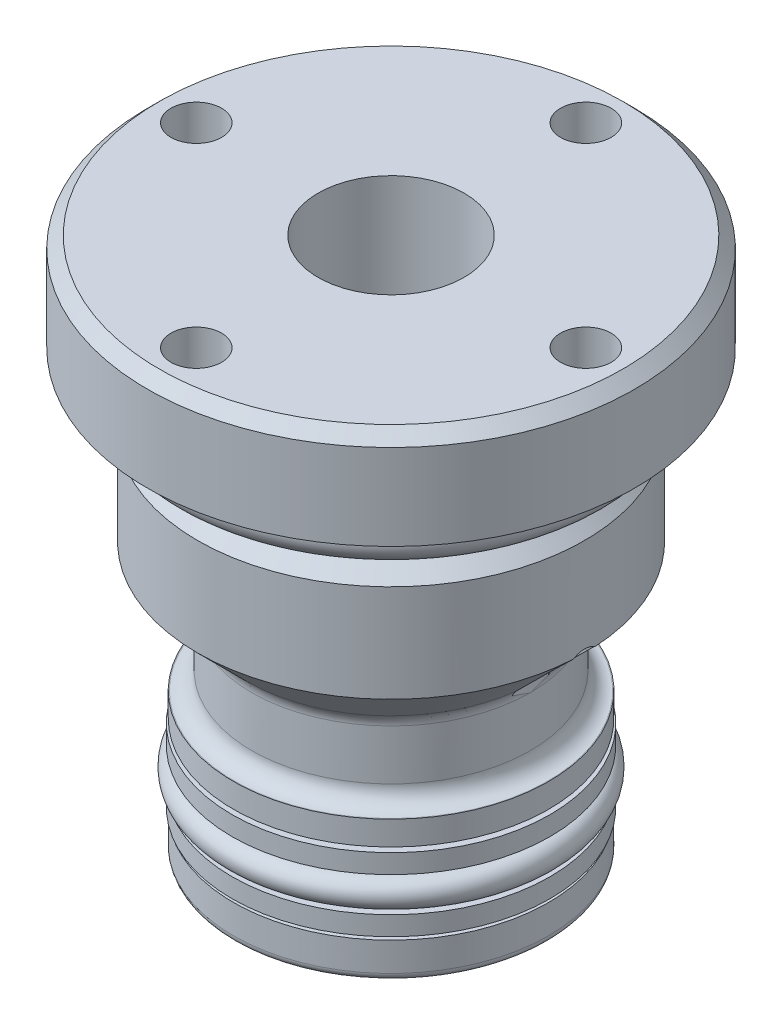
ISO-10303-21;
HEADER;
FILE_DESCRIPTION(('STEP AP214'),'2;1');
FILE_NAME('part.step','',(''),(''),'','','');
FILE_SCHEMA(('AUTOMOTIVE_DESIGN { 1 0 10303 214 1 1 1 1 }'));
ENDSEC;
DATA;
#1=APPLICATION_CONTEXT('core data for automotive mechanical design processes');
#2=APPLICATION_PROTOCOL_DEFINITION('international standard','automotive_design',2000,#1);
#3=PRODUCT_CONTEXT('',#1,'mechanical');
#4=PRODUCT('Part','Part','',(#3));
#5=PRODUCT_RELATED_PRODUCT_CATEGORY('part','',(#4));
#6=PRODUCT_DEFINITION_FORMATION('','',#4);
#7=PRODUCT_DEFINITION_CONTEXT('part definition',#1,'design');
#8=PRODUCT_DEFINITION('design','',#6,#7);
#9=PRODUCT_DEFINITION_SHAPE('','',#8);
#10=(LENGTH_UNIT() NAMED_UNIT(*) SI_UNIT(.MILLI.,.METRE.));
#11=(NAMED_UNIT(*) PLANE_ANGLE_UNIT() SI_UNIT($,.RADIAN.));
#12=(NAMED_UNIT(*) SI_UNIT($,.STERADIAN.) SOLID_ANGLE_UNIT());
#13=UNCERTAINTY_MEASURE_WITH_UNIT(LENGTH_MEASURE(1.E-05),#10,'distance_accuracy_value','');
#14=(GEOMETRIC_REPRESENTATION_CONTEXT(3) GLOBAL_UNCERTAINTY_ASSIGNED_CONTEXT((#13)) GLOBAL_UNIT_ASSIGNED_CONTEXT((#10,
#11,#12)) REPRESENTATION_CONTEXT('',''));
#15=CARTESIAN_POINT('',(0.,0.,0.));
#16=DIRECTION('',(0.,0.,1.));
#17=DIRECTION('',(1.,0.,0.));
#18=AXIS2_PLACEMENT_3D('',#15,#16,#17);
#19=CARTESIAN_POINT('',(0.,17.6403,0.));
#20=DIRECTION('',(0.,1.,0.));
#21=DIRECTION('',(0.,0.,1.));
#22=AXIS2_PLACEMENT_3D('',#19,#20,#21);
#23=CONICAL_SURFACE('',#22,12.6111,0.785398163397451);
#24=CARTESIAN_POINT('',(-12.8232836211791,17.85386,0.187886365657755));
#25=CARTESIAN_POINT('',(-12.8182436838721,17.8492403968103,0.216582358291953));
#26=CARTESIAN_POINT('',(-12.8120798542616,17.8435892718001,0.244882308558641));
#27=CARTESIAN_POINT('',(-12.7977048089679,17.8304009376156,0.300453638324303));
#28=CARTESIAN_POINT('',(-12.7894971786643,17.822867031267,0.327726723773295));
#29=CARTESIAN_POINT('',(-12.7622909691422,17.7978736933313,0.407171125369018));
#30=CARTESIAN_POINT('',(-12.7405810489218,17.7779056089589,0.457651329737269));
#31=CARTESIAN_POINT('',(-12.691732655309,17.73287308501,0.552794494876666));
#32=CARTESIAN_POINT('',(-12.6646313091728,17.7078434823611,0.597493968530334));
#33=CARTESIAN_POINT('',(-12.6061936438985,17.6537282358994,0.68153112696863));
#34=CARTESIAN_POINT('',(-12.574843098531,17.6246289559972,0.720849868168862));
#35=CARTESIAN_POINT('',(-12.4881202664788,17.5438862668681,0.81745229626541));
#36=CARTESIAN_POINT('',(-12.4301494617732,17.4896736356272,0.870261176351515));
#37=CARTESIAN_POINT('',(-12.30923931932,17.3759277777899,0.962737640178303));
#38=CARTESIAN_POINT('',(-12.2462907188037,17.3163846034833,1.00237997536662));
#39=CARTESIAN_POINT('',(-12.0956977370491,17.1729851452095,1.08090261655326));
#40=CARTESIAN_POINT('',(-12.0068984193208,17.0877141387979,1.11499531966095));
#41=CARTESIAN_POINT('',(-11.8273735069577,16.9135562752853,1.16283816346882));
#42=CARTESIAN_POINT('',(-11.7366458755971,16.8246654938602,1.17656558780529));
#43=CARTESIAN_POINT('',(-11.5547095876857,16.6443837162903,1.1837854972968));
#44=CARTESIAN_POINT('',(-11.4635079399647,16.5529755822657,1.17703665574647));
#45=CARTESIAN_POINT('',(-11.2844066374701,16.3712028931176,1.14162836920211));
#46=CARTESIAN_POINT('',(-11.1965014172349,16.2808367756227,1.11300777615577));
#47=CARTESIAN_POINT('',(-11.0541437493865,16.1325666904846,1.04456221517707));
#48=CARTESIAN_POINT('',(-10.9978940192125,16.0734237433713,1.01113037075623));
#49=CARTESIAN_POINT('',(-10.8901115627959,15.9590711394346,0.932077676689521));
#50=CARTESIAN_POINT('',(-10.8385719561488,15.9038557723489,0.886475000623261));
#51=CARTESIAN_POINT('',(-10.7534152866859,15.8118478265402,0.794303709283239));
#52=CARTESIAN_POINT('',(-10.7183986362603,15.7737342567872,0.750354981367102));
#53=CARTESIAN_POINT('',(-10.6537780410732,15.7029792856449,0.654714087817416));
#54=CARTESIAN_POINT('',(-10.6241673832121,15.6703311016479,0.603031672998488));
#55=CARTESIAN_POINT('',(-10.5766703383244,15.6177093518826,0.502505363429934));
#56=CARTESIAN_POINT('',(-10.5576312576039,15.5965106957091,0.454851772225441));
#57=CARTESIAN_POINT('',(-10.5251333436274,15.5602203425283,0.355462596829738));
#58=CARTESIAN_POINT('',(-10.5116715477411,15.5451254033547,0.303729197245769));
#59=CARTESIAN_POINT('',(-10.4910695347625,15.5219872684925,0.197145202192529));
#60=CARTESIAN_POINT('',(-10.483965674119,15.513984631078,0.142278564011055));
#61=CARTESIAN_POINT('',(-10.4767154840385,15.5058169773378,0.0315109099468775));
#62=CARTESIAN_POINT('',(-10.4765666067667,15.5056490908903,-0.0243897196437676));
#63=CARTESIAN_POINT('',(-10.4829036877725,15.5127883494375,-0.129885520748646));
#64=CARTESIAN_POINT('',(-10.4887541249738,15.5193794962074,-0.179570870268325));
#65=CARTESIAN_POINT('',(-10.5057926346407,15.5385271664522,-0.276813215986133));
#66=CARTESIAN_POINT('',(-10.5169808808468,15.5510838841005,-0.32437014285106));
#67=CARTESIAN_POINT('',(-10.54450257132,15.5818644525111,-0.417589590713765));
#68=CARTESIAN_POINT('',(-10.560970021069,15.6002357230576,-0.463163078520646));
#69=CARTESIAN_POINT('',(-10.5982058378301,15.6415950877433,-0.550255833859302));
#70=CARTESIAN_POINT('',(-10.6189764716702,15.6645856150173,-0.591772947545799));
#71=CARTESIAN_POINT('',(-10.6741262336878,15.7253259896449,-0.687857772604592));
#72=CARTESIAN_POINT('',(-10.7104531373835,15.7650969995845,-0.74003663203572));
#73=CARTESIAN_POINT('',(-10.7886620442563,15.8500350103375,-0.835000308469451));
#74=CARTESIAN_POINT('',(-10.8305555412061,15.8952131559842,-0.877765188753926));
#75=CARTESIAN_POINT('',(-10.9337057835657,16.0055346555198,-0.967565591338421));
#76=CARTESIAN_POINT('',(-10.9966195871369,16.0721454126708,-1.01088782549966));
#77=CARTESIAN_POINT('',(-11.1270923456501,16.2087722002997,-1.08235352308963));
#78=CARTESIAN_POINT('',(-11.1946572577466,16.2787925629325,-1.11047709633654));
#79=CARTESIAN_POINT('',(-11.3515438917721,16.4396994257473,-1.15857781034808));
#80=CARTESIAN_POINT('',(-11.4417438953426,16.5310342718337,-1.17419513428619));
#81=CARTESIAN_POINT('',(-11.6238846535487,16.7132659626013,-1.18435298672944));
#82=CARTESIAN_POINT('',(-11.7158278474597,16.8041619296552,-1.17886141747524));
#83=CARTESIAN_POINT('',(-11.8996660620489,16.98399448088,-1.14703342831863));
#84=CARTESIAN_POINT('',(-11.991553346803,17.0729063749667,-1.12051162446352));
#85=CARTESIAN_POINT('',(-12.1713263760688,17.2452609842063,-1.0454882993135));
#86=CARTESIAN_POINT('',(-12.2592220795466,17.3287175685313,-0.997045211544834));
#87=CARTESIAN_POINT('',(-12.3925056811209,17.4543190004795,-0.900516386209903));
#88=CARTESIAN_POINT('',(-12.4406980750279,17.4995115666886,-0.86022376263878));
#89=CARTESIAN_POINT('',(-12.5324735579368,17.5852366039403,-0.770359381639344));
#90=CARTESIAN_POINT('',(-12.5760611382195,17.6257736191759,-0.720796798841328));
#91=CARTESIAN_POINT('',(-12.6470315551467,17.6915672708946,-0.624514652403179));
#92=CARTESIAN_POINT('',(-12.675831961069,17.7181907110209,-0.579782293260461));
#93=CARTESIAN_POINT('',(-12.7278340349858,17.7661679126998,-0.484701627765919));
#94=CARTESIAN_POINT('',(-12.7510550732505,17.7875399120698,-0.434373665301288));
#95=CARTESIAN_POINT('',(-12.7820804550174,17.8160567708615,-0.350840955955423));
#96=CARTESIAN_POINT('',(-12.7922729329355,17.8254154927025,-0.319264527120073));
#97=CARTESIAN_POINT('',(-12.8099276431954,17.8416159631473,-0.254608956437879));
#98=CARTESIAN_POINT('',(-12.8173798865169,17.8484485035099,-0.221524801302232));
#99=CARTESIAN_POINT('',(-12.8232836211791,17.85386,-0.187886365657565));
#100=B_SPLINE_CURVE_WITH_KNOTS('',3,(#24,#25,#26,#27,#28,#29,#30,#31,#32,#33,#34,#35,#36,#37,
#38,#39,#40,#41,#42,#43,#44,#45,#46,#47,#48,#49,#50,#51,#52,#53,#54,#55,#56,#57,#58,#59,#60,#61,
#62,#63,#64,#65,#66,#67,#68,#69,#70,#71,#72,#73,#74,#75,#76,#77,#78,#79,#80,#81,#82,#83,#84,#85,
#86,#87,#88,#89,#90,#91,#92,#93,#94,#95,#96,#97,#98,#99),.UNSPECIFIED.,.F.,.F.,(4,2,2,2,2,2,2,2,
2,2,2,2,2,2,2,2,2,2,2,2,2,2,2,2,2,2,2,2,2,2,2,2,2,2,2,2,2,4),(0.,0.0884031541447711,
0.176652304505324,0.351070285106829,0.524326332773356,0.698177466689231,0.982577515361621,
1.26751983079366,1.6487844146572,2.0304739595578,2.4166793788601,2.80220035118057,
3.06596773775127,3.32934344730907,3.53231894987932,3.73504065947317,3.90093071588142,
4.06673253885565,4.23347651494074,4.40015940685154,4.55084203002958,4.70152955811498,
4.85639339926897,5.01133902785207,5.23507270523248,5.45927573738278,5.76168123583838,
6.06448153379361,6.45045830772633,6.83702222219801,7.22703214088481,7.6160085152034,
7.84752987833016,8.07882330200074,8.25669679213,8.43394352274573,8.537155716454,
8.64074050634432),.UNSPECIFIED.);
#101=CARTESIAN_POINT('',(-12.591747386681,17.6402999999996,0.698384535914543));
#102=VERTEX_POINT('',#101);
#103=CARTESIAN_POINT('',(-11.5986187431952,16.6878,1.18110000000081));
#104=VERTEX_POINT('',#103);
#105=EDGE_CURVE('E192',#102,#104,#100,.T.);
#106=ORIENTED_EDGE('',*,*,#105,.T.);
#107=CARTESIAN_POINT('',(-16.919809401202,21.9901830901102,1.18110000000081));
#108=CARTESIAN_POINT('',(-15.9606787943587,21.0334393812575,1.18110000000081));
#109=CARTESIAN_POINT('',(-15.0014133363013,20.0768305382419,1.18110000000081));
#110=CARTESIAN_POINT('',(-13.5619843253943,18.642453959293,1.18110000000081));
#111=CARTESIAN_POINT('',(-13.0820871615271,18.1644188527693,1.18110000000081));
#112=CARTESIAN_POINT('',(-12.1220599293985,17.2085820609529,1.18110000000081));
#113=CARTESIAN_POINT('',(-11.6419298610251,16.7307803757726,1.18110000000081));
#114=CARTESIAN_POINT('',(-10.6813300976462,15.7755131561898,1.18110000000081));
#115=CARTESIAN_POINT('',(-10.2008604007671,15.2980476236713,1.18110000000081));
#116=CARTESIAN_POINT('',(-9.23941950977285,14.3436225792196,1.18110000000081));
#117=CARTESIAN_POINT('',(-8.75844831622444,13.8666630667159,1.18110000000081));
#118=CARTESIAN_POINT('',(-8.03638005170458,13.1518388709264,1.18110000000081));
#119=CARTESIAN_POINT('',(-7.79558808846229,12.9136660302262,1.18110000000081));
#120=CARTESIAN_POINT('',(-7.31373343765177,12.437594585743,1.18110000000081));
#121=CARTESIAN_POINT('',(-7.07267075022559,12.1996959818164,1.18110000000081));
#122=CARTESIAN_POINT('',(-6.59018668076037,11.72426069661,1.18110000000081));
#123=CARTESIAN_POINT('',(-6.3487652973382,11.4867240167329,1.18110000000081));
#124=CARTESIAN_POINT('',(-5.86540743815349,11.0121745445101,1.18110000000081));
#125=CARTESIAN_POINT('',(-5.6234709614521,10.775161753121,1.18110000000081));
#126=CARTESIAN_POINT('',(-5.38119871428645,10.5384918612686,1.18110000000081));
#127=B_SPLINE_CURVE_WITH_KNOTS('',3,(#107,#108,#109,#110,#111,#112,#113,#114,#115,#116,#117,
#118,#119,#120,#121,#122,#123,#124,#125,#126),.UNSPECIFIED.,.F.,.F.,(4,2,2,2,2,2,2,2,2,4),(0.,
4.06418656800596,6.09627158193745,8.12835757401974,10.1604548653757,12.1925498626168,
13.2086026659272,14.2246549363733,15.2407111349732,16.256769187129),.UNSPECIFIED.);
#128=CARTESIAN_POINT('',(-9.34090160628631,14.4444769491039,1.18110000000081));
#129=VERTEX_POINT('',#128);
#130=EDGE_CURVE('E273',#104,#129,#127,.T.);
#131=ORIENTED_EDGE('',*,*,#130,.T.);
#132=CARTESIAN_POINT('',(0.,14.4444769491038,0.));
#133=DIRECTION('',(0.,1.,0.));
#134=DIRECTION('',(0.,0.,1.));
#135=AXIS2_PLACEMENT_3D('',#132,#133,#134);
#136=CIRCLE('',#135,9.41527694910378);
#137=CARTESIAN_POINT('',(9.34090160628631,14.4444769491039,1.18110000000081));
#138=VERTEX_POINT('',#137);
#139=EDGE_CURVE('E339',#129,#138,#136,.T.);
#140=ORIENTED_EDGE('',*,*,#139,.T.);
#141=CARTESIAN_POINT('',(15.4733336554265,20.547545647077,1.18110000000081));
#142=CARTESIAN_POINT('',(14.9936631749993,20.0692742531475,1.18110000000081));
#143=CARTESIAN_POINT('',(14.5139355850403,19.5910600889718,1.18110000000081));
#144=CARTESIAN_POINT('',(13.554307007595,18.6348075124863,1.18110000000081));
#145=CARTESIAN_POINT('',(13.0744060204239,18.1567690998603,1.18110000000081));
#146=CARTESIAN_POINT('',(12.1143751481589,17.2009329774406,1.18110000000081));
#147=CARTESIAN_POINT('',(11.6342452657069,16.7231352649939,1.18110000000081));
#148=CARTESIAN_POINT('',(10.6736481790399,15.767877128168,1.18110000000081));
#149=CARTESIAN_POINT('',(10.1931809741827,15.2904167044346,1.18110000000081));
#150=CARTESIAN_POINT('',(9.23173083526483,14.335997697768,1.18110000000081));
#151=CARTESIAN_POINT('',(8.75074789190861,13.8590391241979,1.18110000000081));
#152=CARTESIAN_POINT('',(7.78798194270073,12.9059336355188,1.18110000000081));
#153=CARTESIAN_POINT('',(7.30619894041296,12.4297867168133,1.18110000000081));
#154=CARTESIAN_POINT('',(6.58244867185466,11.7166489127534,1.18110000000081));
#155=CARTESIAN_POINT('',(6.34101707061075,11.4791145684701,1.18110000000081));
#156=CARTESIAN_POINT('',(5.85764973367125,11.0045605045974,1.18110000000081));
#157=CARTESIAN_POINT('',(5.61571399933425,10.7675407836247,1.18110000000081));
#158=CARTESIAN_POINT('',(5.13111532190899,10.2942373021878,1.18110000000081));
#159=CARTESIAN_POINT('',(4.8884523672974,10.0579535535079,1.18110000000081));
#160=CARTESIAN_POINT('',(4.52362855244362,9.70438116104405,1.18110000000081));
#161=CARTESIAN_POINT('',(4.40188183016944,9.58666537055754,1.18110000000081));
#162=CARTESIAN_POINT('',(4.15803045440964,9.35160440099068,1.18110000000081));
#163=CARTESIAN_POINT('',(4.03592579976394,9.23425922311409,1.18110000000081));
#164=CARTESIAN_POINT('',(3.913601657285,9.11714265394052,1.18110000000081));
#165=B_SPLINE_CURVE_WITH_KNOTS('',3,(#141,#142,#143,#144,#145,#146,#147,#148,#149,#150,#151,
#152,#153,#154,#155,#156,#157,#158,#159,#160,#161,#162,#163,#164),.UNSPECIFIED.,.F.,.F.,(4,2,2,
2,2,2,2,2,2,2,2,4),(0.,2.03210379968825,4.06420392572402,6.09628114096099,8.12836223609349,
10.160480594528,12.1925899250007,13.2086632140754,14.2247337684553,15.2408205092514,
15.7488684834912,16.2569181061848),.UNSPECIFIED.);
#166=CARTESIAN_POINT('',(11.5986187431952,16.6878,1.18110000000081));
#167=VERTEX_POINT('',#166);
#168=EDGE_CURVE('E234',#167,#138,#165,.T.);
#169=ORIENTED_EDGE('',*,*,#168,.F.);
#170=CARTESIAN_POINT('',(12.8232836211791,17.85386,-0.187886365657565));
#171=CARTESIAN_POINT('',(12.8182436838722,17.8492403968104,-0.216582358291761));
#172=CARTESIAN_POINT('',(12.8120798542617,17.8435892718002,-0.244882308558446));
#173=CARTESIAN_POINT('',(12.797704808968,17.8304009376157,-0.300453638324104));
#174=CARTESIAN_POINT('',(12.7894971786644,17.822867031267,-0.327726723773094));
#175=CARTESIAN_POINT('',(12.7622909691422,17.7978736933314,-0.407171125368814));
#176=CARTESIAN_POINT('',(12.7405810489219,17.777905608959,-0.457651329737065));
#177=CARTESIAN_POINT('',(12.6917326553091,17.7328730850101,-0.552794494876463));
#178=CARTESIAN_POINT('',(12.664631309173,17.7078434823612,-0.597493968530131));
#179=CARTESIAN_POINT('',(12.6061936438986,17.6537282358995,-0.681531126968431));
#180=CARTESIAN_POINT('',(12.5748430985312,17.6246289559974,-0.720849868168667));
#181=CARTESIAN_POINT('',(12.488120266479,17.5438862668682,-0.817452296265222));
#182=CARTESIAN_POINT('',(12.4301494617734,17.4896736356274,-0.870261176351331));
#183=CARTESIAN_POINT('',(12.3092393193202,17.3759277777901,-0.962737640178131));
#184=CARTESIAN_POINT('',(12.246290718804,17.3163846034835,-1.00237997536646));
#185=CARTESIAN_POINT('',(12.0956977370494,17.1729851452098,-1.08090261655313));
#186=CARTESIAN_POINT('',(12.0068984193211,17.0877141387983,-1.11499531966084));
#187=CARTESIAN_POINT('',(11.8273735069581,16.9135562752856,-1.16283816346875));
#188=CARTESIAN_POINT('',(11.7366458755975,16.8246654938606,-1.17656558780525));
#189=CARTESIAN_POINT('',(11.554709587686,16.6443837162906,-1.18378549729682));
#190=CARTESIAN_POINT('',(11.4635079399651,16.5529755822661,-1.17703665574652));
#191=CARTESIAN_POINT('',(11.2844066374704,16.371202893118,-1.14162836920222));
#192=CARTESIAN_POINT('',(11.1965014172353,16.2808367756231,-1.11300777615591));
#193=CARTESIAN_POINT('',(11.0541437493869,16.132566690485,-1.04456221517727));
#194=CARTESIAN_POINT('',(10.9978940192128,16.0734237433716,-1.01113037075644));
#195=CARTESIAN_POINT('',(10.8901115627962,15.9590711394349,-0.932077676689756));
#196=CARTESIAN_POINT('',(10.838571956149,15.9038557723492,-0.886475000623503));
#197=CARTESIAN_POINT('',(10.7534152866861,15.8118478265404,-0.794303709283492));
#198=CARTESIAN_POINT('',(10.7183986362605,15.7737342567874,-0.750354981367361));
#199=CARTESIAN_POINT('',(10.6537780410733,15.7029792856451,-0.654714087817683));
#200=CARTESIAN_POINT('',(10.6241673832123,15.670331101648,-0.603031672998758));
#201=CARTESIAN_POINT('',(10.5766703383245,15.6177093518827,-0.502505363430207));
#202=CARTESIAN_POINT('',(10.557631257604,15.5965106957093,-0.454851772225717));
#203=CARTESIAN_POINT('',(10.5251333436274,15.5602203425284,-0.355462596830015));
#204=CARTESIAN_POINT('',(10.5116715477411,15.5451254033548,-0.303729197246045));
#205=CARTESIAN_POINT('',(10.4910695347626,15.5219872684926,-0.197145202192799));
#206=CARTESIAN_POINT('',(10.4839656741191,15.5139846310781,-0.142278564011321));
#207=CARTESIAN_POINT('',(10.4767154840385,15.5058169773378,-0.0315109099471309));
#208=CARTESIAN_POINT('',(10.4765666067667,15.5056490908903,0.0243897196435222));
#209=CARTESIAN_POINT('',(10.4829036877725,15.5127883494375,0.129885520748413));
#210=CARTESIAN_POINT('',(10.4887541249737,15.5193794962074,0.179570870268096));
#211=CARTESIAN_POINT('',(10.5057926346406,15.5385271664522,0.276813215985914));
#212=CARTESIAN_POINT('',(10.5169808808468,15.5510838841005,0.324370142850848));
#213=CARTESIAN_POINT('',(10.5445025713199,15.581864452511,0.41758959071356));
#214=CARTESIAN_POINT('',(10.5609700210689,15.6002357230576,0.463163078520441));
#215=CARTESIAN_POINT('',(10.59820583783,15.6415950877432,0.550255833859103));
#216=CARTESIAN_POINT('',(10.6189764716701,15.6645856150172,0.591772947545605));
#217=CARTESIAN_POINT('',(10.6741262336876,15.7253259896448,0.687857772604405));
#218=CARTESIAN_POINT('',(10.7104531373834,15.7650969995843,0.740036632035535));
#219=CARTESIAN_POINT('',(10.7886620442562,15.8500350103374,0.835000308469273));
#220=CARTESIAN_POINT('',(10.8305555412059,15.895213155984,0.877765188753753));
#221=CARTESIAN_POINT('',(10.9337057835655,16.0055346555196,0.967565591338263));
#222=CARTESIAN_POINT('',(10.9966195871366,16.0721454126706,1.01088782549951));
#223=CARTESIAN_POINT('',(11.1270923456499,16.2087722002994,1.08235352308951));
#224=CARTESIAN_POINT('',(11.1946572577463,16.2787925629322,1.11047709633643));
#225=CARTESIAN_POINT('',(11.3515438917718,16.439699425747,1.15857781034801));
#226=CARTESIAN_POINT('',(11.4417438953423,16.5310342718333,1.17419513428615));
#227=CARTESIAN_POINT('',(11.6238846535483,16.713265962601,1.18435298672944));
#228=CARTESIAN_POINT('',(11.7158278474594,16.8041619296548,1.17886141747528));
#229=CARTESIAN_POINT('',(11.8996660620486,16.9839944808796,1.14703342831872));
#230=CARTESIAN_POINT('',(11.9915533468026,17.0729063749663,1.12051162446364));
#231=CARTESIAN_POINT('',(12.1713263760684,17.2452609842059,1.04548829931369));
#232=CARTESIAN_POINT('',(12.2592220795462,17.328717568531,0.997045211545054));
#233=CARTESIAN_POINT('',(12.3925056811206,17.4543190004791,0.900516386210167));
#234=CARTESIAN_POINT('',(12.4406980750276,17.4995115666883,0.860223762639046));
#235=CARTESIAN_POINT('',(12.5324735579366,17.5852366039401,0.770359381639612));
#236=CARTESIAN_POINT('',(12.5760611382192,17.6257736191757,0.720796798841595));
#237=CARTESIAN_POINT('',(12.6470315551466,17.6915672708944,0.624514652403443));
#238=CARTESIAN_POINT('',(12.6758319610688,17.7181907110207,0.579782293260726));
#239=CARTESIAN_POINT('',(12.7278340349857,17.7661679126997,0.484701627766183));
#240=CARTESIAN_POINT('',(12.7510550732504,17.7875399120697,0.434373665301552));
#241=CARTESIAN_POINT('',(12.7820804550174,17.8160567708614,0.350840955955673));
#242=CARTESIAN_POINT('',(12.7922729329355,17.8254154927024,0.319264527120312));
#243=CARTESIAN_POINT('',(12.8099276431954,17.8416159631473,0.254608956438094));
#244=CARTESIAN_POINT('',(12.8173798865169,17.8484485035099,0.221524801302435));
#245=CARTESIAN_POINT('',(12.8232836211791,17.85386,0.187886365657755));
#246=B_SPLINE_CURVE_WITH_KNOTS('',3,(#170,#171,#172,#173,#174,#175,#176,#177,#178,#179,#180,
#181,#182,#183,#184,#185,#186,#187,#188,#189,#190,#191,#192,#193,#194,#195,#196,#197,#198,#199,
#200,#201,#202,#203,#204,#205,#206,#207,#208,#209,#210,#211,#212,#213,#214,#215,#216,#217,#218,
#219,#220,#221,#222,#223,#224,#225,#226,#227,#228,#229,#230,#231,#232,#233,#234,#235,#236,#237,
#238,#239,#240,#241,#242,#243,#244,#245),.UNSPECIFIED.,.F.,.F.,(4,2,2,2,2,2,2,2,2,2,2,2,2,2,2,2,
2,2,2,2,2,2,2,2,2,2,2,2,2,2,2,2,2,2,2,2,2,4),(0.,0.0884031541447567,0.176652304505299,
0.351070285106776,0.524326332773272,0.698177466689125,0.982577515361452,1.26751983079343,
1.64878441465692,2.03047395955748,2.41667937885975,2.80220035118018,3.06596773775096,
3.32934344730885,3.53231894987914,3.73504065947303,3.90093071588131,4.06673253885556,
4.23347651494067,4.40015940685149,4.55084203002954,4.70152955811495,4.85639339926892,
5.01133902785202,5.23507270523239,5.45927573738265,5.7616812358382,6.06448153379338,
6.45045830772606,6.8370222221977,7.22703214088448,7.61600851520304,7.8475298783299,
8.07882330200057,8.25669679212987,8.43394352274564,8.53715571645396,8.64074050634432),.UNSPECIFIED.);
#247=CARTESIAN_POINT('',(12.5917473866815,17.6403,0.698384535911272));
#248=VERTEX_POINT('',#247);
#249=EDGE_CURVE('E211',#167,#248,#246,.T.);
#250=ORIENTED_EDGE('',*,*,#249,.T.);
#251=CARTESIAN_POINT('',(0.,17.6403,0.));
#252=DIRECTION('',(0.,-1.,0.));
#253=DIRECTION('',(0.,0.,-1.));
#254=AXIS2_PLACEMENT_3D('',#251,#252,#253);
#255=CIRCLE('',#254,12.6111);
#256=EDGE_CURVE('E425',#248,#102,#255,.T.);
#257=ORIENTED_EDGE('',*,*,#256,.T.);
#258=EDGE_LOOP('',(#106,#131,#140,#169,#250,#257));
#259=FACE_BOUND('',#258,.T.);
#260=ADVANCED_FACE('F34',(#259),#23,.T.);
#261=CARTESIAN_POINT('',(0.,13.6362538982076,0.));
#262=DIRECTION('',(0.,-1.,0.));
#263=DIRECTION('',(0.,0.,-1.));
#264=AXIS2_PLACEMENT_3D('',#261,#262,#263);
#265=TOROIDAL_SURFACE('',#264,10.2235,1.143);
#266=ORIENTED_EDGE('',*,*,#139,.F.);
#267=CARTESIAN_POINT('',(-9.0546396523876,13.9733749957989,1.18110000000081));
#268=CARTESIAN_POINT('',(-9.03570817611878,13.9125493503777,1.18110000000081));
#269=CARTESIAN_POINT('',(-9.02189127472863,13.8500845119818,1.18110000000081));
#270=CARTESIAN_POINT('',(-9.00493453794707,13.7236714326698,1.18110000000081));
#271=CARTESIAN_POINT('',(-9.00180692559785,13.6597215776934,1.18110000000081));
#272=CARTESIAN_POINT('',(-9.00634415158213,13.5322291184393,1.18110000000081));
#273=CARTESIAN_POINT('',(-9.0140041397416,13.4686863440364,1.18110000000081));
#274=CARTESIAN_POINT('',(-9.03987787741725,13.3438051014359,1.18110000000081));
#275=CARTESIAN_POINT('',(-9.05808920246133,13.2824661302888,1.18110000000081));
#276=CARTESIAN_POINT('',(-9.10453481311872,13.1636672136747,1.18110000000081));
#277=CARTESIAN_POINT('',(-9.1327750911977,13.1062096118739,1.18110000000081));
#278=CARTESIAN_POINT('',(-9.19844845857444,12.9968118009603,1.18110000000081));
#279=CARTESIAN_POINT('',(-9.23588211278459,12.9448719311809,1.18110000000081));
#280=CARTESIAN_POINT('',(-9.31910275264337,12.8476559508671,1.18110000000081));
#281=CARTESIAN_POINT('',(-9.36493702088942,12.8024203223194,1.18110000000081));
#282=CARTESIAN_POINT('',(-9.46349757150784,12.7202130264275,1.18110000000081));
#283=CARTESIAN_POINT('',(-9.51622413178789,12.6832416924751,1.18110000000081));
#284=CARTESIAN_POINT('',(-9.62751630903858,12.6183099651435,1.18110000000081));
#285=CARTESIAN_POINT('',(-9.6861243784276,12.5904223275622,1.18110000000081));
#286=CARTESIAN_POINT('',(-9.8071723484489,12.5448175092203,1.18110000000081));
#287=CARTESIAN_POINT('',(-9.86961237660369,12.5271006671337,1.18110000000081));
#288=CARTESIAN_POINT('',(-9.99693846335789,12.5022505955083,1.18110000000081));
#289=CARTESIAN_POINT('',(-10.0618365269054,12.4951788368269,1.18110000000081));
#290=CARTESIAN_POINT('',(-10.1919006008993,12.4920143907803,1.18110000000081));
#291=CARTESIAN_POINT('',(-10.2570666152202,12.4959218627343,1.18110000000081));
#292=CARTESIAN_POINT('',(-10.3859062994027,12.51463070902,1.18110000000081));
#293=CARTESIAN_POINT('',(-10.4495778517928,12.5294466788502,1.18110000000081));
#294=CARTESIAN_POINT('',(-10.5735175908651,12.569589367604,1.18110000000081));
#295=CARTESIAN_POINT('',(-10.6337858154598,12.5949159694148,1.18110000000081));
#296=CARTESIAN_POINT('',(-10.7490109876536,12.6552919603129,1.18110000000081));
#297=CARTESIAN_POINT('',(-10.8039831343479,12.6903123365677,1.18110000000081));
#298=CARTESIAN_POINT('',(-10.9072257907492,12.7691324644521,1.18110000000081));
#299=CARTESIAN_POINT('',(-10.9554964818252,12.8129319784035,1.18110000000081));
#300=CARTESIAN_POINT('',(-11.0436837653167,12.9078136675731,1.18110000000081));
#301=CARTESIAN_POINT('',(-11.0836443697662,12.9588549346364,1.18110000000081));
#302=CARTESIAN_POINT('',(-11.1543721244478,13.0669530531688,1.18110000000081));
#303=CARTESIAN_POINT('',(-11.1851395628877,13.1240097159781,1.18110000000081));
#304=CARTESIAN_POINT('',(-11.2364309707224,13.2421760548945,1.18110000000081));
#305=CARTESIAN_POINT('',(-11.2570111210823,13.3032613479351,1.18110000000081));
#306=CARTESIAN_POINT('',(-11.2875803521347,13.4280267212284,1.18110000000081));
#307=CARTESIAN_POINT('',(-11.2975696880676,13.4917067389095,1.18110000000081));
#308=CARTESIAN_POINT('',(-11.3066464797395,13.6195974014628,1.18110000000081));
#309=CARTESIAN_POINT('',(-11.305774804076,13.6838051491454,1.18110000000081));
#310=CARTESIAN_POINT('',(-11.2932544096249,13.8111605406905,1.18110000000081));
#311=CARTESIAN_POINT('',(-11.2816057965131,13.8743081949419,1.18110000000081));
#312=CARTESIAN_POINT('',(-11.24788576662,13.9977009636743,1.18110000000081));
#313=CARTESIAN_POINT('',(-11.225822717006,14.0579483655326,1.18110000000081));
#314=CARTESIAN_POINT('',(-11.1719182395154,14.1738962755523,1.18110000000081));
#315=CARTESIAN_POINT('',(-11.1400767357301,14.2295967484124,1.18110000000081));
#316=CARTESIAN_POINT('',(-11.0674477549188,14.3350176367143,1.18110000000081));
#317=CARTESIAN_POINT('',(-11.0266392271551,14.3847235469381,1.18110000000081));
#318=CARTESIAN_POINT('',(-10.9372930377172,14.4766194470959,1.18110000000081));
#319=CARTESIAN_POINT('',(-10.8887552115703,14.5188092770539,1.18110000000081));
#320=CARTESIAN_POINT('',(-10.785080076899,14.5946979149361,1.18110000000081));
#321=CARTESIAN_POINT('',(-10.7299119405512,14.6283546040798,1.18110000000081));
#322=CARTESIAN_POINT('',(-10.6147330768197,14.6859897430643,1.18110000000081));
#323=CARTESIAN_POINT('',(-10.5547221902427,14.7099678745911,1.18110000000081));
#324=CARTESIAN_POINT('',(-10.4311908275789,14.7477089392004,1.18110000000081));
#325=CARTESIAN_POINT('',(-10.3676521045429,14.761412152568,1.18110000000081));
#326=CARTESIAN_POINT('',(-10.239177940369,14.7780100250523,1.18110000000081));
#327=CARTESIAN_POINT('',(-10.174242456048,14.7809043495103,1.18110000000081));
#328=CARTESIAN_POINT('',(-10.0445038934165,14.7758022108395,1.18110000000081));
#329=CARTESIAN_POINT('',(-9.97970276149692,14.7677561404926,1.18110000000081));
#330=CARTESIAN_POINT('',(-9.85236858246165,14.7409124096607,1.18110000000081));
#331=CARTESIAN_POINT('',(-9.78983548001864,14.7221150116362,1.18110000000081));
#332=CARTESIAN_POINT('',(-9.66875282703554,14.6742649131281,1.18110000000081));
#333=CARTESIAN_POINT('',(-9.61020720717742,14.6452022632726,1.18110000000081));
#334=CARTESIAN_POINT('',(-9.49883360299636,14.5776179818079,1.18110000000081));
#335=CARTESIAN_POINT('',(-9.44600697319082,14.5390941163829,1.18110000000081));
#336=CARTESIAN_POINT('',(-9.34778285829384,14.4538063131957,1.18110000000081));
#337=CARTESIAN_POINT('',(-9.30236280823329,14.4070683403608,1.18110000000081));
#338=CARTESIAN_POINT('',(-9.22012938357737,14.3066155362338,1.18110000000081));
#339=CARTESIAN_POINT('',(-9.18330532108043,14.2529094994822,1.18110000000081));
#340=CARTESIAN_POINT('',(-9.13128615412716,14.1611777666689,1.18110000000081));
#341=CARTESIAN_POINT('',(-9.11314955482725,14.1247870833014,1.18110000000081));
#342=CARTESIAN_POINT('',(-9.08086203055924,14.0502780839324,1.18110000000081));
#343=CARTESIAN_POINT('',(-9.06671109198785,14.012159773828,1.18110000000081));
#344=CARTESIAN_POINT('',(-9.0546396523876,13.9733749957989,1.18110000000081));
#345=B_SPLINE_CURVE_WITH_KNOTS('',3,(#267,#268,#269,#270,#271,#272,#273,#274,#275,#276,#277,
#278,#279,#280,#281,#282,#283,#284,#285,#286,#287,#288,#289,#290,#291,#292,#293,#294,#295,#296,
#297,#298,#299,#300,#301,#302,#303,#304,#305,#306,#307,#308,#309,#310,#311,#312,#313,#314,#315,
#316,#317,#318,#319,#320,#321,#322,#323,#324,#325,#326,#327,#328,#329,#330,#331,#332,#333,#334,
#335,#336,#337,#338,#339,#340,#341,#342,#343,#344),.UNSPECIFIED.,.T.,.F.,(4,2,2,2,2,2,2,2,2,2,2,
2,2,2,2,2,2,2,2,2,2,2,2,2,2,2,2,2,2,2,2,2,2,2,2,2,2,2,4),(0.,0.190963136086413,
0.382144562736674,0.573240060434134,0.764291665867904,0.955457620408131,1.14663532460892,
1.33892409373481,1.53122061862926,1.72502149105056,1.91882881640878,2.11375106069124,
2.30867613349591,2.50386248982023,2.69904667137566,2.89365288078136,3.08825382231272,
3.28179627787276,3.47533266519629,3.6677895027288,3.86024170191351,4.05196994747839,
4.24369631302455,4.43526890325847,4.62684298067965,4.81887169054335,5.01090448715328,
5.20386745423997,5.39683676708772,5.59091913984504,5.7850075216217,5.97997890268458,
6.17494552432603,6.37010163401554,6.56530386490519,6.75989980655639,6.95425249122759,
7.07601836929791,7.19778383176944),.UNSPECIFIED.);
#346=CARTESIAN_POINT('',(-9.0805,14.0473582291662,1.18110000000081));
#347=VERTEX_POINT('',#346);
#348=EDGE_CURVE('E252',#129,#347,#345,.T.);
#349=ORIENTED_EDGE('',*,*,#348,.T.);
#350=CARTESIAN_POINT('',(-9.0805,13.6362538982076,0.));
#351=CARTESIAN_POINT('',(-9.0805,13.6383780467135,0.00598712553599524));
#352=CARTESIAN_POINT('',(-9.0805,13.6405022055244,0.0119742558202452));
#353=CARTESIAN_POINT('',(-9.08050000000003,13.7701364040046,0.377363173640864));
#354=CARTESIAN_POINT('',(-9.08050000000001,13.8975919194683,0.736812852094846));
#355=CARTESIAN_POINT('',(-9.0805,14.0803652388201,1.27861377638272));
#356=CARTESIAN_POINT('',(-9.0805,14.1398545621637,1.45954155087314));
#357=CARTESIAN_POINT('',(-9.0805,14.2545590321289,1.82280805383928));
#358=CARTESIAN_POINT('',(-9.0805,14.3097731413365,2.00514711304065));
#359=CARTESIAN_POINT('',(-9.0805,14.4179881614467,2.38476011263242));
#360=CARTESIAN_POINT('',(-9.0805,14.4705423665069,2.58216286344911));
#361=CARTESIAN_POINT('',(-9.0805,14.566305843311,2.97913455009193));
#362=CARTESIAN_POINT('',(-9.0805,14.609521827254,3.17870182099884));
#363=CARTESIAN_POINT('',(-9.0805,14.6652107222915,3.48049916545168));
#364=CARTESIAN_POINT('',(-9.0805,14.6822966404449,3.58188078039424));
#365=CARTESIAN_POINT('',(-9.0805,14.7128498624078,3.78517683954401));
#366=CARTESIAN_POINT('',(-9.0805,14.7263177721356,3.88709119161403));
#367=CARTESIAN_POINT('',(-9.0805,14.7491313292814,4.0916563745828));
#368=CARTESIAN_POINT('',(-9.0805,14.7584663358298,4.19430842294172));
#369=CARTESIAN_POINT('',(-9.0805,14.7722911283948,4.39999483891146));
#370=CARTESIAN_POINT('',(-9.0805,14.7767780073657,4.5030293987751));
#371=CARTESIAN_POINT('',(-9.0805,14.7784983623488,4.6061460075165));
#372=B_SPLINE_CURVE_WITH_KNOTS('',3,(#350,#351,#352,#353,#354,#355,#356,#357,#358,#359,#360,
#361,#362,#363,#364,#365,#366,#367,#368,#369,#370,#371),.UNSPECIFIED.,.F.,.F.,(4,2,2,2,2,2,2,2,
2,2,4),(0.,0.0190583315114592,1.16310942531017,1.73444398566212,2.30591675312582,
2.91859880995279,3.53083900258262,3.83921977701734,4.1475488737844,4.45666726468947,
4.76597090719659),.UNSPECIFIED.);
#373=CARTESIAN_POINT('',(-9.0805,13.6362538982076,0.));
#374=VERTEX_POINT('',#373);
#375=EDGE_CURVE('E319',#374,#347,#372,.T.);
#376=ORIENTED_EDGE('',*,*,#375,.F.);
#377=CARTESIAN_POINT('',(0.,13.6362538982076,0.));
#378=DIRECTION('',(0.,-1.,0.));
#379=DIRECTION('',(0.,0.,-1.));
#380=AXIS2_PLACEMENT_3D('',#377,#378,#379);
#381=CIRCLE('',#380,9.0805);
#382=CARTESIAN_POINT('',(9.0805,13.6362538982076,0.));
#383=VERTEX_POINT('',#382);
#384=EDGE_CURVE('E331',#383,#374,#381,.T.);
#385=ORIENTED_EDGE('',*,*,#384,.F.);
#386=CARTESIAN_POINT('',(9.0805,13.6362538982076,0.));
#387=CARTESIAN_POINT('',(9.0805,13.6383780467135,0.00598712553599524));
#388=CARTESIAN_POINT('',(9.0805,13.6405022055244,0.0119742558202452));
#389=CARTESIAN_POINT('',(9.08050000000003,13.7701364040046,0.377363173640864));
#390=CARTESIAN_POINT('',(9.08050000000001,13.8975919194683,0.736812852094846));
#391=CARTESIAN_POINT('',(9.0805,14.0803652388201,1.27861377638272));
#392=CARTESIAN_POINT('',(9.0805,14.1398545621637,1.45954155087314));
#393=CARTESIAN_POINT('',(9.0805,14.2545590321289,1.82280805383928));
#394=CARTESIAN_POINT('',(9.0805,14.3097731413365,2.00514711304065));
#395=CARTESIAN_POINT('',(9.0805,14.4179881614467,2.38476011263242));
#396=CARTESIAN_POINT('',(9.0805,14.4705423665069,2.58216286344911));
#397=CARTESIAN_POINT('',(9.0805,14.566305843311,2.97913455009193));
#398=CARTESIAN_POINT('',(9.0805,14.609521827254,3.17870182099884));
#399=CARTESIAN_POINT('',(9.0805,14.6652107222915,3.48049916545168));
#400=CARTESIAN_POINT('',(9.0805,14.6822966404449,3.58188078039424));
#401=CARTESIAN_POINT('',(9.0805,14.7128498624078,3.78517683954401));
#402=CARTESIAN_POINT('',(9.0805,14.7263177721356,3.88709119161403));
#403=CARTESIAN_POINT('',(9.0805,14.7491313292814,4.0916563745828));
#404=CARTESIAN_POINT('',(9.0805,14.7584663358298,4.19430842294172));
#405=CARTESIAN_POINT('',(9.0805,14.7722911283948,4.39999483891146));
#406=CARTESIAN_POINT('',(9.0805,14.7767780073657,4.5030293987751));
#407=CARTESIAN_POINT('',(9.0805,14.7784983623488,4.6061460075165));
#408=B_SPLINE_CURVE_WITH_KNOTS('',3,(#386,#387,#388,#389,#390,#391,#392,#393,#394,#395,#396,
#397,#398,#399,#400,#401,#402,#403,#404,#405,#406,#407),.UNSPECIFIED.,.F.,.F.,(4,2,2,2,2,2,2,2,
2,2,4),(0.,0.0190583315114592,1.16310942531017,1.73444398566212,2.30591675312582,
2.91859880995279,3.53083900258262,3.83921977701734,4.1475488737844,4.45666726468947,
4.76597090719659),.UNSPECIFIED.);
#409=CARTESIAN_POINT('',(9.0805,14.0473582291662,1.18110000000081));
#410=VERTEX_POINT('',#409);
#411=EDGE_CURVE('E283',#410,#383,#408,.F.);
#412=ORIENTED_EDGE('',*,*,#411,.F.);
#413=CARTESIAN_POINT('',(9.0546396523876,13.9733749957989,1.18110000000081));
#414=CARTESIAN_POINT('',(9.03570817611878,13.9125493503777,1.18110000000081));
#415=CARTESIAN_POINT('',(9.02189127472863,13.8500845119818,1.18110000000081));
#416=CARTESIAN_POINT('',(9.00493453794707,13.7236714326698,1.18110000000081));
#417=CARTESIAN_POINT('',(9.00180692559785,13.6597215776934,1.18110000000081));
#418=CARTESIAN_POINT('',(9.00634415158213,13.5322291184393,1.18110000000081));
#419=CARTESIAN_POINT('',(9.0140041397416,13.4686863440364,1.18110000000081));
#420=CARTESIAN_POINT('',(9.03987787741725,13.3438051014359,1.18110000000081));
#421=CARTESIAN_POINT('',(9.05808920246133,13.2824661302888,1.18110000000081));
#422=CARTESIAN_POINT('',(9.10453481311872,13.1636672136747,1.18110000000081));
#423=CARTESIAN_POINT('',(9.1327750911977,13.1062096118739,1.18110000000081));
#424=CARTESIAN_POINT('',(9.19844845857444,12.9968118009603,1.18110000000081));
#425=CARTESIAN_POINT('',(9.23588211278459,12.9448719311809,1.18110000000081));
#426=CARTESIAN_POINT('',(9.31910275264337,12.8476559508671,1.18110000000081));
#427=CARTESIAN_POINT('',(9.36493702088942,12.8024203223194,1.18110000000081));
#428=CARTESIAN_POINT('',(9.46349757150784,12.7202130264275,1.18110000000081));
#429=CARTESIAN_POINT('',(9.51622413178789,12.6832416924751,1.18110000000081));
#430=CARTESIAN_POINT('',(9.62751630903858,12.6183099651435,1.18110000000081));
#431=CARTESIAN_POINT('',(9.6861243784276,12.5904223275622,1.18110000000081));
#432=CARTESIAN_POINT('',(9.8071723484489,12.5448175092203,1.18110000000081));
#433=CARTESIAN_POINT('',(9.86961237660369,12.5271006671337,1.18110000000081));
#434=CARTESIAN_POINT('',(9.99693846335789,12.5022505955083,1.18110000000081));
#435=CARTESIAN_POINT('',(10.0618365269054,12.4951788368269,1.18110000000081));
#436=CARTESIAN_POINT('',(10.1919006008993,12.4920143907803,1.18110000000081));
#437=CARTESIAN_POINT('',(10.2570666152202,12.4959218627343,1.18110000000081));
#438=CARTESIAN_POINT('',(10.3859062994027,12.51463070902,1.18110000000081));
#439=CARTESIAN_POINT('',(10.4495778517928,12.5294466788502,1.18110000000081));
#440=CARTESIAN_POINT('',(10.5735175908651,12.569589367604,1.18110000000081));
#441=CARTESIAN_POINT('',(10.6337858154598,12.5949159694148,1.18110000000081));
#442=CARTESIAN_POINT('',(10.7490109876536,12.6552919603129,1.18110000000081));
#443=CARTESIAN_POINT('',(10.8039831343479,12.6903123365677,1.18110000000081));
#444=CARTESIAN_POINT('',(10.9072257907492,12.7691324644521,1.18110000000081));
#445=CARTESIAN_POINT('',(10.9554964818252,12.8129319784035,1.18110000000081));
#446=CARTESIAN_POINT('',(11.0436837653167,12.9078136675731,1.18110000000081));
#447=CARTESIAN_POINT('',(11.0836443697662,12.9588549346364,1.18110000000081));
#448=CARTESIAN_POINT('',(11.1543721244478,13.0669530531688,1.18110000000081));
#449=CARTESIAN_POINT('',(11.1851395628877,13.1240097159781,1.18110000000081));
#450=CARTESIAN_POINT('',(11.2364309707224,13.2421760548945,1.18110000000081));
#451=CARTESIAN_POINT('',(11.2570111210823,13.3032613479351,1.18110000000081));
#452=CARTESIAN_POINT('',(11.2875803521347,13.4280267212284,1.18110000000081));
#453=CARTESIAN_POINT('',(11.2975696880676,13.4917067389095,1.18110000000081));
#454=CARTESIAN_POINT('',(11.3066464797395,13.6195974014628,1.18110000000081));
#455=CARTESIAN_POINT('',(11.305774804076,13.6838051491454,1.18110000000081));
#456=CARTESIAN_POINT('',(11.2932544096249,13.8111605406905,1.18110000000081));
#457=CARTESIAN_POINT('',(11.2816057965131,13.8743081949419,1.18110000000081));
#458=CARTESIAN_POINT('',(11.24788576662,13.9977009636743,1.18110000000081));
#459=CARTESIAN_POINT('',(11.225822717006,14.0579483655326,1.18110000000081));
#460=CARTESIAN_POINT('',(11.1719182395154,14.1738962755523,1.18110000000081));
#461=CARTESIAN_POINT('',(11.1400767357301,14.2295967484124,1.18110000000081));
#462=CARTESIAN_POINT('',(11.0674477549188,14.3350176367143,1.18110000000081));
#463=CARTESIAN_POINT('',(11.0266392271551,14.3847235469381,1.18110000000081));
#464=CARTESIAN_POINT('',(10.9372930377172,14.4766194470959,1.18110000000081));
#465=CARTESIAN_POINT('',(10.8887552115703,14.5188092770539,1.18110000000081));
#466=CARTESIAN_POINT('',(10.785080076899,14.5946979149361,1.18110000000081));
#467=CARTESIAN_POINT('',(10.7299119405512,14.6283546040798,1.18110000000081));
#468=CARTESIAN_POINT('',(10.6147330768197,14.6859897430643,1.18110000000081));
#469=CARTESIAN_POINT('',(10.5547221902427,14.7099678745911,1.18110000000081));
#470=CARTESIAN_POINT('',(10.4311908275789,14.7477089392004,1.18110000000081));
#471=CARTESIAN_POINT('',(10.3676521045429,14.761412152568,1.18110000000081));
#472=CARTESIAN_POINT('',(10.239177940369,14.7780100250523,1.18110000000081));
#473=CARTESIAN_POINT('',(10.174242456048,14.7809043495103,1.18110000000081));
#474=CARTESIAN_POINT('',(10.0445038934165,14.7758022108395,1.18110000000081));
#475=CARTESIAN_POINT('',(9.97970276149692,14.7677561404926,1.18110000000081));
#476=CARTESIAN_POINT('',(9.85236858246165,14.7409124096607,1.18110000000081));
#477=CARTESIAN_POINT('',(9.78983548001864,14.7221150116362,1.18110000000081));
#478=CARTESIAN_POINT('',(9.66875282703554,14.6742649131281,1.18110000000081));
#479=CARTESIAN_POINT('',(9.61020720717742,14.6452022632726,1.18110000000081));
#480=CARTESIAN_POINT('',(9.49883360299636,14.5776179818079,1.18110000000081));
#481=CARTESIAN_POINT('',(9.44600697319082,14.5390941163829,1.18110000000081));
#482=CARTESIAN_POINT('',(9.34778285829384,14.4538063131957,1.18110000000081));
#483=CARTESIAN_POINT('',(9.30236280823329,14.4070683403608,1.18110000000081));
#484=CARTESIAN_POINT('',(9.22012938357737,14.3066155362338,1.18110000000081));
#485=CARTESIAN_POINT('',(9.18330532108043,14.2529094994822,1.18110000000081));
#486=CARTESIAN_POINT('',(9.13128615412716,14.1611777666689,1.18110000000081));
#487=CARTESIAN_POINT('',(9.11314955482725,14.1247870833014,1.18110000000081));
#488=CARTESIAN_POINT('',(9.08086203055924,14.0502780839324,1.18110000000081));
#489=CARTESIAN_POINT('',(9.06671109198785,14.012159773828,1.18110000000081));
#490=CARTESIAN_POINT('',(9.0546396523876,13.9733749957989,1.18110000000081));
#491=B_SPLINE_CURVE_WITH_KNOTS('',3,(#413,#414,#415,#416,#417,#418,#419,#420,#421,#422,#423,
#424,#425,#426,#427,#428,#429,#430,#431,#432,#433,#434,#435,#436,#437,#438,#439,#440,#441,#442,
#443,#444,#445,#446,#447,#448,#449,#450,#451,#452,#453,#454,#455,#456,#457,#458,#459,#460,#461,
#462,#463,#464,#465,#466,#467,#468,#469,#470,#471,#472,#473,#474,#475,#476,#477,#478,#479,#480,
#481,#482,#483,#484,#485,#486,#487,#488,#489,#490),.UNSPECIFIED.,.T.,.F.,(4,2,2,2,2,2,2,2,2,2,2,
2,2,2,2,2,2,2,2,2,2,2,2,2,2,2,2,2,2,2,2,2,2,2,2,2,2,2,4),(0.,0.190963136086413,
0.382144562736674,0.573240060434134,0.764291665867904,0.955457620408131,1.14663532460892,
1.33892409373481,1.53122061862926,1.72502149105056,1.91882881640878,2.11375106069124,
2.30867613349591,2.50386248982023,2.69904667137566,2.89365288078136,3.08825382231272,
3.28179627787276,3.47533266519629,3.6677895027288,3.86024170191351,4.05196994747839,
4.24369631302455,4.43526890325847,4.62684298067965,4.81887169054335,5.01090448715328,
5.20386745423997,5.39683676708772,5.59091913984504,5.7850075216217,5.97997890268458,
6.17494552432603,6.37010163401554,6.56530386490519,6.75989980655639,6.95425249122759,
7.07601836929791,7.19778383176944),.UNSPECIFIED.);
#492=EDGE_CURVE('E307',#138,#410,#491,.T.);
#493=ORIENTED_EDGE('',*,*,#492,.F.);
#494=EDGE_LOOP('',(#266,#349,#376,#385,#412,#493));
#495=FACE_BOUND('',#494,.T.);
#496=ADVANCED_FACE('F220',(#495),#265,.F.);
#497=CARTESIAN_POINT('',(9.34090160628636,14.4444769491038,-1.18110000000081));
#498=VERTEX_POINT('',#497);
#499=CARTESIAN_POINT('',(-9.34090160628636,14.4444769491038,-1.18110000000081));
#500=VERTEX_POINT('',#499);
#501=EDGE_CURVE('E340',#498,#500,#136,.T.);
#502=ORIENTED_EDGE('',*,*,#501,.T.);
#503=CARTESIAN_POINT('',(-5.38119871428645,10.5384918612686,-1.18110000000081));
#504=CARTESIAN_POINT('',(-5.57358913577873,10.7264212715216,-1.18110000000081));
#505=CARTESIAN_POINT('',(-5.76576070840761,10.9145743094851,-1.18110000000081));
#506=CARTESIAN_POINT('',(-6.1497563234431,11.2912342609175,-1.18110000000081));
#507=CARTESIAN_POINT('',(-6.34158036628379,11.4797411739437,-1.18110000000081));
#508=CARTESIAN_POINT('',(-6.91666604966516,12.0456522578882,-1.18110000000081));
#509=CARTESIAN_POINT('',(-7.29954236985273,12.4234478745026,-1.18110000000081));
#510=CARTESIAN_POINT('',(-8.06465656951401,13.179681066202,-1.18110000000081));
#511=CARTESIAN_POINT('',(-8.44689445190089,13.5581186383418,-1.18110000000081));
#512=CARTESIAN_POINT('',(-9.21094495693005,14.3154232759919,-1.18110000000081));
#513=CARTESIAN_POINT('',(-9.59275757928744,14.6942903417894,-1.18110000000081));
#514=CARTESIAN_POINT('',(-10.1723621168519,15.2698743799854,-1.18110000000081));
#515=CARTESIAN_POINT('',(-10.370262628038,15.4664820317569,-1.18110000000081));
#516=CARTESIAN_POINT('',(-10.7659951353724,15.85976649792,-1.18110000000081));
#517=CARTESIAN_POINT('',(-10.9638271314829,16.0564433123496,-1.18110000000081));
#518=CARTESIAN_POINT('',(-12.1222344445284,17.2084121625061,-1.18110000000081));
#519=CARTESIAN_POINT('',(-13.0821816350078,18.1643358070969,-1.18110000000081));
#520=CARTESIAN_POINT('',(-14.5216108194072,19.5987119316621,-1.18110000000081));
#521=CARTESIAN_POINT('',(-15.001338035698,20.0769185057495,-1.18110000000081));
#522=CARTESIAN_POINT('',(-15.9606626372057,21.0334616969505,-1.18110000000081));
#523=CARTESIAN_POINT('',(-16.4402600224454,21.5117983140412,-1.18110000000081));
#524=CARTESIAN_POINT('',(-16.919809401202,21.9901830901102,-1.18110000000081));
#525=B_SPLINE_CURVE_WITH_KNOTS('',3,(#503,#504,#505,#506,#507,#508,#509,#510,#511,#512,#513,
#514,#515,#516,#517,#518,#519,#520,#521,#522,#523,#524),.UNSPECIFIED.,.F.,.F.,(4,2,2,2,2,2,2,2,
2,2,4),(0.,0.806835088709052,1.6136691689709,3.22733260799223,4.84098866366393,6.45464579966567,
7.2915284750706,8.12841161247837,12.1925954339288,14.2246824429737,16.2567690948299),.UNSPECIFIED.);
#526=CARTESIAN_POINT('',(-11.5986187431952,16.6878,-1.18110000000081));
#527=VERTEX_POINT('',#526);
#528=EDGE_CURVE('E245',#500,#527,#525,.T.);
#529=ORIENTED_EDGE('',*,*,#528,.T.);
#530=CARTESIAN_POINT('',(-12.5917473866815,17.6403,-0.698384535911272));
#531=VERTEX_POINT('',#530);
#532=EDGE_CURVE('E148',#527,#531,#100,.T.);
#533=ORIENTED_EDGE('',*,*,#532,.T.);
#534=CARTESIAN_POINT('',(12.591747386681,17.6402999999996,-0.698384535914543));
#535=VERTEX_POINT('',#534);
#536=EDGE_CURVE('E429',#531,#535,#255,.T.);
#537=ORIENTED_EDGE('',*,*,#536,.T.);
#538=CARTESIAN_POINT('',(11.5986187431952,16.6878,-1.18110000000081));
#539=VERTEX_POINT('',#538);
#540=EDGE_CURVE('E205',#535,#539,#246,.T.);
#541=ORIENTED_EDGE('',*,*,#540,.T.);
#542=CARTESIAN_POINT('',(3.913601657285,9.11714265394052,-1.18110000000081));
#543=CARTESIAN_POINT('',(4.05775084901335,9.25516315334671,-1.18110000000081));
#544=CARTESIAN_POINT('',(4.20160102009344,9.39349492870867,-1.18110000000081));
#545=CARTESIAN_POINT('',(4.48882408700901,9.67065197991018,-1.18110000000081));
#546=CARTESIAN_POINT('',(4.63219698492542,9.80947725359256,-1.18110000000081));
#547=CARTESIAN_POINT('',(4.91858600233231,10.0874919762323,-1.18110000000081));
#548=CARTESIAN_POINT('',(5.06160212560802,10.2266814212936,-1.18110000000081));
#549=CARTESIAN_POINT('',(5.34735425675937,10.5053478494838,-1.18110000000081));
#550=CARTESIAN_POINT('',(5.49009026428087,10.6448248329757,-1.18110000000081));
#551=CARTESIAN_POINT('',(5.91796319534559,11.0635877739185,-1.18110000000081));
#552=CARTESIAN_POINT('',(6.20277021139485,11.3432107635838,-1.18110000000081));
#553=CARTESIAN_POINT('',(6.77180486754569,11.9030468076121,-1.18110000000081));
#554=CARTESIAN_POINT('',(7.05603250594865,12.1832598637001,-1.18110000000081));
#555=CARTESIAN_POINT('',(7.73606404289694,12.8546521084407,-1.18110000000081));
#556=CARTESIAN_POINT('',(8.13167740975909,13.2460242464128,-1.18110000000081));
#557=CARTESIAN_POINT('',(8.92240443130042,14.0292772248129,-1.18110000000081));
#558=CARTESIAN_POINT('',(9.31751808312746,14.4211580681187,-1.18110000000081));
#559=CARTESIAN_POINT('',(10.1931873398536,15.2904224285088,-1.18110000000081));
#560=CARTESIAN_POINT('',(10.673660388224,15.7678891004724,-1.18110000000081));
#561=CARTESIAN_POINT('',(11.6342703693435,16.7231603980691,-1.18110000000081));
#562=CARTESIAN_POINT('',(12.1144073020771,17.2009650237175,-1.18110000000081));
#563=CARTESIAN_POINT('',(13.0744391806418,18.156802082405,-1.18110000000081));
#564=CARTESIAN_POINT('',(13.5543341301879,18.6348345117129,-1.18110000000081));
#565=CARTESIAN_POINT('',(14.5139496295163,19.591074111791,-1.18110000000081));
#566=CARTESIAN_POINT('',(14.9936701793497,20.0692812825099,-1.18110000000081));
#567=CARTESIAN_POINT('',(15.4733336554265,20.547545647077,-1.18110000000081));
#568=B_SPLINE_CURVE_WITH_KNOTS('',3,(#542,#543,#544,#545,#546,#547,#548,#549,#550,#551,#552,
#553,#554,#555,#556,#557,#558,#559,#560,#561,#562,#563,#564,#565,#566,#567),.UNSPECIFIED.,.F.,
.F.,(4,2,2,2,2,2,2,2,2,2,2,2,4),(0.,0.598711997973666,1.19742138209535,1.79612438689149,
2.39482814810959,3.59221397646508,4.78960331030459,6.45907509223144,8.12855636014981,
10.1606631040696,12.1927699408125,14.2248445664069,16.2569185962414),.UNSPECIFIED.);
#569=EDGE_CURVE('E240',#498,#539,#568,.T.);
#570=ORIENTED_EDGE('',*,*,#569,.F.);
#571=EDGE_LOOP('',(#502,#529,#533,#537,#541,#570));
#572=FACE_BOUND('',#571,.T.);
#573=ADVANCED_FACE('F216',(#572),#23,.T.);
#574=CARTESIAN_POINT('',(-9.0805,13.6362538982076,0.));
#575=CARTESIAN_POINT('',(-9.0805,13.6383780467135,-0.00598712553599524));
#576=CARTESIAN_POINT('',(-9.0805,13.6405022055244,-0.0119742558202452));
#577=CARTESIAN_POINT('',(-9.08050000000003,13.7701364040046,-0.377363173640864));
#578=CARTESIAN_POINT('',(-9.08050000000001,13.8975919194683,-0.736812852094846));
#579=CARTESIAN_POINT('',(-9.0805,14.0803652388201,-1.27861377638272));
#580=CARTESIAN_POINT('',(-9.0805,14.1398545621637,-1.45954155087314));
#581=CARTESIAN_POINT('',(-9.0805,14.2545590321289,-1.82280805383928));
#582=CARTESIAN_POINT('',(-9.0805,14.3097731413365,-2.00514711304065));
#583=CARTESIAN_POINT('',(-9.0805,14.4179881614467,-2.38476011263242));
#584=CARTESIAN_POINT('',(-9.0805,14.4705423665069,-2.58216286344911));
#585=CARTESIAN_POINT('',(-9.0805,14.566305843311,-2.97913455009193));
#586=CARTESIAN_POINT('',(-9.0805,14.609521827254,-3.17870182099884));
#587=CARTESIAN_POINT('',(-9.0805,14.6652107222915,-3.48049916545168));
#588=CARTESIAN_POINT('',(-9.0805,14.6822966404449,-3.58188078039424));
#589=CARTESIAN_POINT('',(-9.0805,14.7128498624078,-3.78517683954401));
#590=CARTESIAN_POINT('',(-9.0805,14.7263177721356,-3.88709119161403));
#591=CARTESIAN_POINT('',(-9.0805,14.7491313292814,-4.0916563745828));
#592=CARTESIAN_POINT('',(-9.0805,14.7584663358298,-4.19430842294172));
#593=CARTESIAN_POINT('',(-9.0805,14.7722911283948,-4.39999483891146));
#594=CARTESIAN_POINT('',(-9.0805,14.7767780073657,-4.5030293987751));
#595=CARTESIAN_POINT('',(-9.0805,14.7784983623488,-4.6061460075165));
#596=B_SPLINE_CURVE_WITH_KNOTS('',3,(#574,#575,#576,#577,#578,#579,#580,#581,#582,#583,#584,
#585,#586,#587,#588,#589,#590,#591,#592,#593,#594,#595),.UNSPECIFIED.,.F.,.F.,(4,2,2,2,2,2,2,2,
2,2,4),(0.,0.0190583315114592,1.16310942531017,1.73444398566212,2.30591675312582,
2.91859880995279,3.53083900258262,3.83921977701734,4.1475488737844,4.45666726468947,
4.76597090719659),.UNSPECIFIED.);
#597=CARTESIAN_POINT('',(-9.0805,14.0473582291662,-1.18110000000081));
#598=VERTEX_POINT('',#597);
#599=EDGE_CURVE('E142',#598,#374,#596,.F.);
#600=ORIENTED_EDGE('',*,*,#599,.F.);
#601=CARTESIAN_POINT('',(-9.0546396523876,13.9733749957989,-1.18110000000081));
#602=CARTESIAN_POINT('',(-9.07371295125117,14.0346366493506,-1.18110000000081));
#603=CARTESIAN_POINT('',(-9.09800284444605,14.0943248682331,-1.18110000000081));
#604=CARTESIAN_POINT('',(-9.15630162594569,14.2088126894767,-1.18110000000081));
#605=CARTESIAN_POINT('',(-9.19032282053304,14.2636059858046,-1.18110000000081));
#606=CARTESIAN_POINT('',(-9.26704261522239,14.3666739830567,-1.18110000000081));
#607=CARTESIAN_POINT('',(-9.30973423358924,14.4149538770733,-1.18110000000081));
#608=CARTESIAN_POINT('',(-9.40256260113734,14.5036972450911,-1.18110000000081));
#609=CARTESIAN_POINT('',(-9.45269756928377,14.5441625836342,-1.18110000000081));
#610=CARTESIAN_POINT('',(-9.55930487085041,14.6164033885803,-1.18110000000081));
#611=CARTESIAN_POINT('',(-9.61581219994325,14.6481272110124,-1.18110000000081));
#612=CARTESIAN_POINT('',(-9.73332787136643,14.7017097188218,-1.18110000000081));
#613=CARTESIAN_POINT('',(-9.79433655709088,14.7235676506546,-1.18110000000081));
#614=CARTESIAN_POINT('',(-9.91954357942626,14.7569288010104,-1.18110000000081));
#615=CARTESIAN_POINT('',(-9.98375989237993,14.7683645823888,-1.18110000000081));
#616=CARTESIAN_POINT('',(-10.1132013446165,14.7803207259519,-1.18110000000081));
#617=CARTESIAN_POINT('',(-10.178426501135,14.7808409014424,-1.18110000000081));
#618=CARTESIAN_POINT('',(-10.3081918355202,14.7709314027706,-1.18110000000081));
#619=CARTESIAN_POINT('',(-10.3727300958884,14.7604765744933,-1.18110000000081));
#620=CARTESIAN_POINT('',(-10.4991280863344,14.7288565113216,-1.18110000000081));
#621=CARTESIAN_POINT('',(-10.5609878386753,14.7076913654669,-1.18110000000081));
#622=CARTESIAN_POINT('',(-10.6801208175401,14.6552880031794,-1.18110000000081));
#623=CARTESIAN_POINT('',(-10.7374038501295,14.6240720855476,-1.18110000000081));
#624=CARTESIAN_POINT('',(-10.8458799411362,14.5524190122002,-1.18110000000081));
#625=CARTESIAN_POINT('',(-10.8970731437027,14.5119820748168,-1.18110000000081));
#626=CARTESIAN_POINT('',(-10.9916326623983,14.4232536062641,-1.18110000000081));
#627=CARTESIAN_POINT('',(-11.0350377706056,14.3750034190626,-1.18110000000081));
#628=CARTESIAN_POINT('',(-11.1130750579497,14.2718647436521,-1.18110000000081));
#629=CARTESIAN_POINT('',(-11.1477075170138,14.2169764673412,-1.18110000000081));
#630=CARTESIAN_POINT('',(-11.2070095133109,14.1024582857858,-1.18110000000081));
#631=CARTESIAN_POINT('',(-11.2317349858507,14.0428573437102,-1.18110000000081));
#632=CARTESIAN_POINT('',(-11.2707803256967,13.9203393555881,-1.18110000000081));
#633=CARTESIAN_POINT('',(-11.2851004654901,13.8574223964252,-1.18110000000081));
#634=CARTESIAN_POINT('',(-11.3028756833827,13.7303453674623,-1.18110000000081));
#635=CARTESIAN_POINT('',(-11.306376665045,13.6661917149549,-1.18110000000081));
#636=CARTESIAN_POINT('',(-11.3025411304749,13.5382097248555,-1.18110000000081));
#637=CARTESIAN_POINT('',(-11.2952047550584,13.4743813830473,-1.18110000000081));
#638=CARTESIAN_POINT('',(-11.2699280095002,13.3489571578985,-1.18110000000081));
#639=CARTESIAN_POINT('',(-11.2520029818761,13.2873581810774,-1.18110000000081));
#640=CARTESIAN_POINT('',(-11.2060833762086,13.1680362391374,-1.18110000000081));
#641=CARTESIAN_POINT('',(-11.1780887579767,13.1103132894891,-1.18110000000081));
#642=CARTESIAN_POINT('',(-11.1127823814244,13.0002667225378,-1.18110000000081));
#643=CARTESIAN_POINT('',(-11.075454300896,12.9479527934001,-1.18110000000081));
#644=CARTESIAN_POINT('',(-10.9925811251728,12.8502993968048,-1.18110000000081));
#645=CARTESIAN_POINT('',(-10.9470358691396,12.8049600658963,-1.18110000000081));
#646=CARTESIAN_POINT('',(-10.848809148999,12.7223224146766,-1.18110000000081));
#647=CARTESIAN_POINT('',(-10.7960968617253,12.6850607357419,-1.18110000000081));
#648=CARTESIAN_POINT('',(-10.6851936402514,12.6198568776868,-1.18110000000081));
#649=CARTESIAN_POINT('',(-10.6270025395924,12.5919149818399,-1.18110000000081));
#650=CARTESIAN_POINT('',(-10.5064360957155,12.5459744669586,-1.18110000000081));
#651=CARTESIAN_POINT('',(-10.4440386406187,12.5280338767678,-1.18110000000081));
#652=CARTESIAN_POINT('',(-10.317123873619,12.502825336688,-1.18110000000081));
#653=CARTESIAN_POINT('',(-10.2526064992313,12.4955577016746,-1.18110000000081));
#654=CARTESIAN_POINT('',(-10.1229410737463,12.4918749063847,-1.18110000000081));
#655=CARTESIAN_POINT('',(-10.057791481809,12.4955138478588,-1.18110000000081));
#656=CARTESIAN_POINT('',(-9.92902171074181,12.5136547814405,-1.18110000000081));
#657=CARTESIAN_POINT('',(-9.86540156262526,12.5281569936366,-1.18110000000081));
#658=CARTESIAN_POINT('',(-9.74137313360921,12.5676613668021,-1.18110000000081));
#659=CARTESIAN_POINT('',(-9.68097125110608,12.5926836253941,-1.18110000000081));
#660=CARTESIAN_POINT('',(-9.56524012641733,12.6525391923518,-1.18110000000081));
#661=CARTESIAN_POINT('',(-9.50991086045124,12.6873724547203,-1.18110000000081));
#662=CARTESIAN_POINT('',(-9.40606357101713,12.7657790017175,-1.18110000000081));
#663=CARTESIAN_POINT('',(-9.35752805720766,12.8093291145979,-1.18110000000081));
#664=CARTESIAN_POINT('',(-9.2685197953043,12.9040072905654,-1.18110000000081));
#665=CARTESIAN_POINT('',(-9.2280464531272,12.955134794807,-1.18110000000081));
#666=CARTESIAN_POINT('',(-9.1566098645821,13.0631484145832,-1.18110000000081));
#667=CARTESIAN_POINT('',(-9.12558364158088,13.1199928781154,-1.18110000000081));
#668=CARTESIAN_POINT('',(-9.07359326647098,13.2381297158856,-1.18110000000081));
#669=CARTESIAN_POINT('',(-9.05263118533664,13.2994230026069,-1.18110000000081));
#670=CARTESIAN_POINT('',(-9.02152802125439,13.4242175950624,-1.18110000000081));
#671=CARTESIAN_POINT('',(-9.01130968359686,13.4876996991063,-1.18110000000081));
#672=CARTESIAN_POINT('',(-9.00174726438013,13.6154234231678,-1.18110000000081));
#673=CARTESIAN_POINT('',(-9.00238952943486,13.679663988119,-1.18110000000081));
#674=CARTESIAN_POINT('',(-9.01213108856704,13.7823548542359,-1.18110000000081));
#675=CARTESIAN_POINT('',(-9.01785795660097,13.821155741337,-1.18110000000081));
#676=CARTESIAN_POINT('',(-9.0332878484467,13.8979583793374,-1.18110000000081));
#677=CARTESIAN_POINT('',(-9.04299085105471,13.9359601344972,-1.18110000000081));
#678=CARTESIAN_POINT('',(-9.0546396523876,13.9733749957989,-1.18110000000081));
#679=B_SPLINE_CURVE_WITH_KNOTS('',3,(#601,#602,#603,#604,#605,#606,#607,#608,#609,#610,#611,
#612,#613,#614,#615,#616,#617,#618,#619,#620,#621,#622,#623,#624,#625,#626,#627,#628,#629,#630,
#631,#632,#633,#634,#635,#636,#637,#638,#639,#640,#641,#642,#643,#644,#645,#646,#647,#648,#649,
#650,#651,#652,#653,#654,#655,#656,#657,#658,#659,#660,#661,#662,#663,#664,#665,#666,#667,#668,
#669,#670,#671,#672,#673,#674,#675,#676,#677,#678),.UNSPECIFIED.,.T.,.F.,(4,2,2,2,2,2,2,2,2,2,2,
2,2,2,2,2,2,2,2,2,2,2,2,2,2,2,2,2,2,2,2,2,2,2,2,2,2,2,4),(0.,0.192342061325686,
0.384928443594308,0.57736035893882,0.769746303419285,0.963245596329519,1.15675966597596,
1.35151716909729,1.54627800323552,1.74148619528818,1.93669276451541,2.13146919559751,
2.32624101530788,2.52001399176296,2.71378078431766,2.90643760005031,3.09908937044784,
3.29092262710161,3.48275339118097,3.67430687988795,3.86586113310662,4.05775274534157,
4.24964811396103,4.44239653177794,4.63515080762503,4.82901212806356,5.02287916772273,
5.21770946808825,5.41254371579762,5.60775188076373,5.80295913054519,5.99765419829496,
6.1923349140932,6.38568790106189,6.57908065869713,6.77107307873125,6.96282415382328,
7.08029551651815,7.19776625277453),.UNSPECIFIED.);
#680=EDGE_CURVE('E141',#598,#500,#679,.T.);
#681=ORIENTED_EDGE('',*,*,#680,.T.);
#682=ORIENTED_EDGE('',*,*,#501,.F.);
#683=CARTESIAN_POINT('',(9.0546396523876,13.9733749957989,-1.18110000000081));
#684=CARTESIAN_POINT('',(9.07371295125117,14.0346366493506,-1.18110000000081));
#685=CARTESIAN_POINT('',(9.09800284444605,14.0943248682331,-1.18110000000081));
#686=CARTESIAN_POINT('',(9.15630162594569,14.2088126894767,-1.18110000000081));
#687=CARTESIAN_POINT('',(9.19032282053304,14.2636059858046,-1.18110000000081));
#688=CARTESIAN_POINT('',(9.26704261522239,14.3666739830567,-1.18110000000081));
#689=CARTESIAN_POINT('',(9.30973423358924,14.4149538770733,-1.18110000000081));
#690=CARTESIAN_POINT('',(9.40256260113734,14.5036972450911,-1.18110000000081));
#691=CARTESIAN_POINT('',(9.45269756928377,14.5441625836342,-1.18110000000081));
#692=CARTESIAN_POINT('',(9.55930487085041,14.6164033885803,-1.18110000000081));
#693=CARTESIAN_POINT('',(9.61581219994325,14.6481272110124,-1.18110000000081));
#694=CARTESIAN_POINT('',(9.73332787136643,14.7017097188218,-1.18110000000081));
#695=CARTESIAN_POINT('',(9.79433655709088,14.7235676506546,-1.18110000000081));
#696=CARTESIAN_POINT('',(9.91954357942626,14.7569288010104,-1.18110000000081));
#697=CARTESIAN_POINT('',(9.98375989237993,14.7683645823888,-1.18110000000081));
#698=CARTESIAN_POINT('',(10.1132013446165,14.7803207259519,-1.18110000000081));
#699=CARTESIAN_POINT('',(10.178426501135,14.7808409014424,-1.18110000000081));
#700=CARTESIAN_POINT('',(10.3081918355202,14.7709314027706,-1.18110000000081));
#701=CARTESIAN_POINT('',(10.3727300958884,14.7604765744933,-1.18110000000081));
#702=CARTESIAN_POINT('',(10.4991280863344,14.7288565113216,-1.18110000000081));
#703=CARTESIAN_POINT('',(10.5609878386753,14.7076913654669,-1.18110000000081));
#704=CARTESIAN_POINT('',(10.6801208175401,14.6552880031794,-1.18110000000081));
#705=CARTESIAN_POINT('',(10.7374038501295,14.6240720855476,-1.18110000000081));
#706=CARTESIAN_POINT('',(10.8458799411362,14.5524190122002,-1.18110000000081));
#707=CARTESIAN_POINT('',(10.8970731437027,14.5119820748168,-1.18110000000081));
#708=CARTESIAN_POINT('',(10.9916326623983,14.4232536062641,-1.18110000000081));
#709=CARTESIAN_POINT('',(11.0350377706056,14.3750034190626,-1.18110000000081));
#710=CARTESIAN_POINT('',(11.1130750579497,14.2718647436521,-1.18110000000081));
#711=CARTESIAN_POINT('',(11.1477075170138,14.2169764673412,-1.18110000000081));
#712=CARTESIAN_POINT('',(11.2070095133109,14.1024582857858,-1.18110000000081));
#713=CARTESIAN_POINT('',(11.2317349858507,14.0428573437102,-1.18110000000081));
#714=CARTESIAN_POINT('',(11.2707803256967,13.9203393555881,-1.18110000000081));
#715=CARTESIAN_POINT('',(11.2851004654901,13.8574223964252,-1.18110000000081));
#716=CARTESIAN_POINT('',(11.3028756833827,13.7303453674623,-1.18110000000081));
#717=CARTESIAN_POINT('',(11.306376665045,13.6661917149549,-1.18110000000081));
#718=CARTESIAN_POINT('',(11.3025411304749,13.5382097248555,-1.18110000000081));
#719=CARTESIAN_POINT('',(11.2952047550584,13.4743813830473,-1.18110000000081));
#720=CARTESIAN_POINT('',(11.2699280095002,13.3489571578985,-1.18110000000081));
#721=CARTESIAN_POINT('',(11.2520029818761,13.2873581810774,-1.18110000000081));
#722=CARTESIAN_POINT('',(11.2060833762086,13.1680362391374,-1.18110000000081));
#723=CARTESIAN_POINT('',(11.1780887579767,13.1103132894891,-1.18110000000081));
#724=CARTESIAN_POINT('',(11.1127823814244,13.0002667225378,-1.18110000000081));
#725=CARTESIAN_POINT('',(11.075454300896,12.9479527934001,-1.18110000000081));
#726=CARTESIAN_POINT('',(10.9925811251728,12.8502993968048,-1.18110000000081));
#727=CARTESIAN_POINT('',(10.9470358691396,12.8049600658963,-1.18110000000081));
#728=CARTESIAN_POINT('',(10.848809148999,12.7223224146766,-1.18110000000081));
#729=CARTESIAN_POINT('',(10.7960968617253,12.6850607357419,-1.18110000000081));
#730=CARTESIAN_POINT('',(10.6851936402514,12.6198568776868,-1.18110000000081));
#731=CARTESIAN_POINT('',(10.6270025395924,12.5919149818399,-1.18110000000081));
#732=CARTESIAN_POINT('',(10.5064360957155,12.5459744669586,-1.18110000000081));
#733=CARTESIAN_POINT('',(10.4440386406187,12.5280338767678,-1.18110000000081));
#734=CARTESIAN_POINT('',(10.317123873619,12.502825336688,-1.18110000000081));
#735=CARTESIAN_POINT('',(10.2526064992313,12.4955577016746,-1.18110000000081));
#736=CARTESIAN_POINT('',(10.1229410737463,12.4918749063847,-1.18110000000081));
#737=CARTESIAN_POINT('',(10.057791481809,12.4955138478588,-1.18110000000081));
#738=CARTESIAN_POINT('',(9.92902171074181,12.5136547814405,-1.18110000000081));
#739=CARTESIAN_POINT('',(9.86540156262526,12.5281569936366,-1.18110000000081));
#740=CARTESIAN_POINT('',(9.74137313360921,12.5676613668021,-1.18110000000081));
#741=CARTESIAN_POINT('',(9.68097125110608,12.5926836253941,-1.18110000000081));
#742=CARTESIAN_POINT('',(9.56524012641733,12.6525391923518,-1.18110000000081));
#743=CARTESIAN_POINT('',(9.50991086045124,12.6873724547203,-1.18110000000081));
#744=CARTESIAN_POINT('',(9.40606357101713,12.7657790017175,-1.18110000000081));
#745=CARTESIAN_POINT('',(9.35752805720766,12.8093291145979,-1.18110000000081));
#746=CARTESIAN_POINT('',(9.2685197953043,12.9040072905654,-1.18110000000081));
#747=CARTESIAN_POINT('',(9.2280464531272,12.955134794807,-1.18110000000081));
#748=CARTESIAN_POINT('',(9.1566098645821,13.0631484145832,-1.18110000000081));
#749=CARTESIAN_POINT('',(9.12558364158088,13.1199928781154,-1.18110000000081));
#750=CARTESIAN_POINT('',(9.07359326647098,13.2381297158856,-1.18110000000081));
#751=CARTESIAN_POINT('',(9.05263118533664,13.2994230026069,-1.18110000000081));
#752=CARTESIAN_POINT('',(9.02152802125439,13.4242175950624,-1.18110000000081));
#753=CARTESIAN_POINT('',(9.01130968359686,13.4876996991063,-1.18110000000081));
#754=CARTESIAN_POINT('',(9.00174726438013,13.6154234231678,-1.18110000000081));
#755=CARTESIAN_POINT('',(9.00238952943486,13.679663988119,-1.18110000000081));
#756=CARTESIAN_POINT('',(9.01213108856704,13.7823548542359,-1.18110000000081));
#757=CARTESIAN_POINT('',(9.01785795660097,13.821155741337,-1.18110000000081));
#758=CARTESIAN_POINT('',(9.0332878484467,13.8979583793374,-1.18110000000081));
#759=CARTESIAN_POINT('',(9.04299085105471,13.9359601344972,-1.18110000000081));
#760=CARTESIAN_POINT('',(9.0546396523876,13.9733749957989,-1.18110000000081));
#761=B_SPLINE_CURVE_WITH_KNOTS('',3,(#683,#684,#685,#686,#687,#688,#689,#690,#691,#692,#693,
#694,#695,#696,#697,#698,#699,#700,#701,#702,#703,#704,#705,#706,#707,#708,#709,#710,#711,#712,
#713,#714,#715,#716,#717,#718,#719,#720,#721,#722,#723,#724,#725,#726,#727,#728,#729,#730,#731,
#732,#733,#734,#735,#736,#737,#738,#739,#740,#741,#742,#743,#744,#745,#746,#747,#748,#749,#750,
#751,#752,#753,#754,#755,#756,#757,#758,#759,#760),.UNSPECIFIED.,.T.,.F.,(4,2,2,2,2,2,2,2,2,2,2,
2,2,2,2,2,2,2,2,2,2,2,2,2,2,2,2,2,2,2,2,2,2,2,2,2,2,2,4),(0.,0.192342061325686,
0.384928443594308,0.57736035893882,0.769746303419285,0.963245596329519,1.15675966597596,
1.35151716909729,1.54627800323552,1.74148619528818,1.93669276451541,2.13146919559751,
2.32624101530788,2.52001399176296,2.71378078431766,2.90643760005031,3.09908937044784,
3.29092262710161,3.48275339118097,3.67430687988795,3.86586113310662,4.05775274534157,
4.24964811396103,4.44239653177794,4.63515080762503,4.82901212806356,5.02287916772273,
5.21770946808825,5.41254371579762,5.60775188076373,5.80295913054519,5.99765419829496,
6.1923349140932,6.38568790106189,6.57908065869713,6.77107307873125,6.96282415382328,
7.08029551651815,7.19776625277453),.UNSPECIFIED.);
#762=CARTESIAN_POINT('',(9.0805,14.0473582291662,-1.18110000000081));
#763=VERTEX_POINT('',#762);
#764=EDGE_CURVE('E311',#763,#498,#761,.T.);
#765=ORIENTED_EDGE('',*,*,#764,.F.);
#766=CARTESIAN_POINT('',(9.0805,13.6362538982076,0.));
#767=CARTESIAN_POINT('',(9.0805,13.6383780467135,-0.00598712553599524));
#768=CARTESIAN_POINT('',(9.0805,13.6405022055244,-0.0119742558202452));
#769=CARTESIAN_POINT('',(9.08050000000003,13.7701364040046,-0.377363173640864));
#770=CARTESIAN_POINT('',(9.08050000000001,13.8975919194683,-0.736812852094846));
#771=CARTESIAN_POINT('',(9.0805,14.0803652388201,-1.27861377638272));
#772=CARTESIAN_POINT('',(9.0805,14.1398545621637,-1.45954155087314));
#773=CARTESIAN_POINT('',(9.0805,14.2545590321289,-1.82280805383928));
#774=CARTESIAN_POINT('',(9.0805,14.3097731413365,-2.00514711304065));
#775=CARTESIAN_POINT('',(9.0805,14.4179881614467,-2.38476011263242));
#776=CARTESIAN_POINT('',(9.0805,14.4705423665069,-2.58216286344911));
#777=CARTESIAN_POINT('',(9.0805,14.566305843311,-2.97913455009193));
#778=CARTESIAN_POINT('',(9.0805,14.609521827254,-3.17870182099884));
#779=CARTESIAN_POINT('',(9.0805,14.6652107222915,-3.48049916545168));
#780=CARTESIAN_POINT('',(9.0805,14.6822966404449,-3.58188078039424));
#781=CARTESIAN_POINT('',(9.0805,14.7128498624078,-3.78517683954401));
#782=CARTESIAN_POINT('',(9.0805,14.7263177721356,-3.88709119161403));
#783=CARTESIAN_POINT('',(9.0805,14.7491313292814,-4.0916563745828));
#784=CARTESIAN_POINT('',(9.0805,14.7584663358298,-4.19430842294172));
#785=CARTESIAN_POINT('',(9.0805,14.7722911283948,-4.39999483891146));
#786=CARTESIAN_POINT('',(9.0805,14.7767780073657,-4.5030293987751));
#787=CARTESIAN_POINT('',(9.0805,14.7784983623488,-4.6061460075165));
#788=B_SPLINE_CURVE_WITH_KNOTS('',3,(#766,#767,#768,#769,#770,#771,#772,#773,#774,#775,#776,
#777,#778,#779,#780,#781,#782,#783,#784,#785,#786,#787),.UNSPECIFIED.,.F.,.F.,(4,2,2,2,2,2,2,2,
2,2,4),(0.,0.0190583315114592,1.16310942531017,1.73444398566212,2.30591675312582,
2.91859880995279,3.53083900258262,3.83921977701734,4.1475488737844,4.45666726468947,
4.76597090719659),.UNSPECIFIED.);
#789=EDGE_CURVE('E289',#383,#763,#788,.T.);
#790=ORIENTED_EDGE('',*,*,#789,.F.);
#791=EDGE_CURVE('E333',#374,#383,#381,.T.);
#792=ORIENTED_EDGE('',*,*,#791,.F.);
#793=EDGE_LOOP('',(#600,#681,#682,#765,#790,#792));
#794=FACE_BOUND('',#793,.T.);
#795=ADVANCED_FACE('F178',(#794),#265,.F.);
#796=CARTESIAN_POINT('',(-15.874999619,16.6878,0.));
#797=DIRECTION('',(1.,0.,0.));
#798=DIRECTION('',(0.,0.,-1.));
#799=AXIS2_PLACEMENT_3D('',#796,#797,#798);
#800=CYLINDRICAL_SURFACE('',#799,1.1811);
#801=CARTESIAN_POINT('',(7.84913428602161,16.6878,-1.1811));
#802=CARTESIAN_POINT('',(7.84913538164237,16.7537476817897,-1.18109727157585));
#803=CARTESIAN_POINT('',(7.8499744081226,16.8197337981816,-1.17555796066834));
#804=CARTESIAN_POINT('',(7.85323763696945,16.9498615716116,-1.15355270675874));
#805=CARTESIAN_POINT('',(7.85566339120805,17.0140013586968,-1.13707606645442));
#806=CARTESIAN_POINT('',(7.86181938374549,17.138534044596,-1.09369963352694));
#807=CARTESIAN_POINT('',(7.86554862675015,17.1989297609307,-1.06680779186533));
#808=CARTESIAN_POINT('',(7.87389022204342,17.3143429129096,-1.00338295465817));
#809=CARTESIAN_POINT('',(7.87850245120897,17.36936109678,-0.966851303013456));
#810=CARTESIAN_POINT('',(7.88813097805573,17.4728996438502,-0.884876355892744));
#811=CARTESIAN_POINT('',(7.89314989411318,17.5213714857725,-0.839372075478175));
#812=CARTESIAN_POINT('',(7.90300291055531,17.6100210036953,-0.740875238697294));
#813=CARTESIAN_POINT('',(7.90783700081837,17.6501982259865,-0.687882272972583));
#814=CARTESIAN_POINT('',(7.91680306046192,17.7212968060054,-0.575601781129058));
#815=CARTESIAN_POINT('',(7.92093160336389,17.7521735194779,-0.516285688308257));
#816=CARTESIAN_POINT('',(7.92799240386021,17.8035081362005,-0.393237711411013));
#817=CARTESIAN_POINT('',(7.93092472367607,17.8239665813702,-0.329506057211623));
#818=CARTESIAN_POINT('',(7.93524421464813,17.8537369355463,-0.199935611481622));
#819=CARTESIAN_POINT('',(7.93664264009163,17.8631300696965,-0.134115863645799));
#820=CARTESIAN_POINT('',(7.93777534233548,17.870755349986,-0.00182058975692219));
#821=CARTESIAN_POINT('',(7.93750971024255,17.8689881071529,0.0646549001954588));
#822=CARTESIAN_POINT('',(7.93535322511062,17.8544069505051,0.195820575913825));
#823=CARTESIAN_POINT('',(7.9334752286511,17.8416804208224,0.260520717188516));
#824=CARTESIAN_POINT('',(7.92831935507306,17.8056790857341,0.386856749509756));
#825=CARTESIAN_POINT('',(7.92504144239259,17.7824040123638,0.448492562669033));
#826=CARTESIAN_POINT('',(7.91743194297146,17.7258766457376,0.567215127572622));
#827=CARTESIAN_POINT('',(7.91309647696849,17.6925875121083,0.624284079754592));
#828=CARTESIAN_POINT('',(7.90385515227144,17.6170038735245,0.732058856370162));
#829=CARTESIAN_POINT('',(7.89894925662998,17.5747087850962,0.782764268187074));
#830=CARTESIAN_POINT('',(7.88905824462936,17.4818269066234,0.876887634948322));
#831=CARTESIAN_POINT('',(7.88407282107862,17.4311638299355,0.920230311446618));
#832=CARTESIAN_POINT('',(7.87463098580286,17.3232434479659,0.997810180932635));
#833=CARTESIAN_POINT('',(7.87017457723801,17.2659861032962,1.03204731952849));
#834=CARTESIAN_POINT('',(7.86229543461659,17.1464246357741,1.09045411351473));
#835=CARTESIAN_POINT('',(7.8588734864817,17.084116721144,1.11461611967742));
#836=CARTESIAN_POINT('',(7.85346468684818,16.9562649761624,1.15211150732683));
#837=CARTESIAN_POINT('',(7.85147773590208,16.8907213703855,1.16544563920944));
#838=CARTESIAN_POINT('',(7.84918272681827,16.7589282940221,1.18080371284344));
#839=CARTESIAN_POINT('',(7.84885883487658,16.6926915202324,1.18293432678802));
#840=CARTESIAN_POINT('',(7.8498845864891,16.5608067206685,1.17610785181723));
#841=CARTESIAN_POINT('',(7.85123417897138,16.4951586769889,1.16715110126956));
#842=CARTESIAN_POINT('',(7.8554402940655,16.3666447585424,1.13849458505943));
#843=CARTESIAN_POINT('',(7.85828937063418,16.3037667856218,1.11884788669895));
#844=CARTESIAN_POINT('',(7.86516729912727,16.1821965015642,1.06942434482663));
#845=CARTESIAN_POINT('',(7.8691962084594,16.1235043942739,1.03964700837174));
#846=CARTESIAN_POINT('',(7.87801718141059,16.0114934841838,0.970550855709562));
#847=CARTESIAN_POINT('',(7.88281468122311,15.9582177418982,0.931162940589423));
#848=CARTESIAN_POINT('',(7.89261586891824,15.8589943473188,0.844059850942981));
#849=CARTESIAN_POINT('',(7.89761956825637,15.8130471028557,0.796344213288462));
#850=CARTESIAN_POINT('',(7.9073188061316,15.7294023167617,0.693470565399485));
#851=CARTESIAN_POINT('',(7.91201148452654,15.6917754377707,0.638254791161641));
#852=CARTESIAN_POINT('',(7.92051558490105,15.6263316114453,0.522224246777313));
#853=CARTESIAN_POINT('',(7.92432703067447,15.5985143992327,0.461409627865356));
#854=CARTESIAN_POINT('',(7.93062667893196,15.5535926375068,0.336129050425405));
#855=CARTESIAN_POINT('',(7.93311966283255,15.5364493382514,0.271677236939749));
#856=CARTESIAN_POINT('',(7.93652155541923,15.5132365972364,0.140769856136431));
#857=CARTESIAN_POINT('',(7.937430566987,15.5071664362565,0.0743144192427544));
#858=CARTESIAN_POINT('',(7.93756109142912,15.5062896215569,-0.058028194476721));
#859=CARTESIAN_POINT('',(7.93679880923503,15.5113748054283,-0.123914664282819));
#860=CARTESIAN_POINT('',(7.93370504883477,15.5324326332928,-0.253884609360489));
#861=CARTESIAN_POINT('',(7.93137357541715,15.5484052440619,-0.317968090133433));
#862=CARTESIAN_POINT('',(7.9254021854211,15.590746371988,-0.44248405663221));
#863=CARTESIAN_POINT('',(7.92176319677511,15.617107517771,-0.502919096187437));
#864=CARTESIAN_POINT('',(7.91357663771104,15.6794659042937,-0.618525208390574));
#865=CARTESIAN_POINT('',(7.90902903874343,15.7154634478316,-0.67369611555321));
#866=CARTESIAN_POINT('',(7.89947848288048,15.7964643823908,-0.777756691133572));
#867=CARTESIAN_POINT('',(7.89447171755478,15.8415476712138,-0.826583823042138));
#868=CARTESIAN_POINT('',(7.88459541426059,15.9392722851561,-0.916019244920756));
#869=CARTESIAN_POINT('',(7.87972590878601,15.9919153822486,-0.956625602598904));
#870=CARTESIAN_POINT('',(7.87064663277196,16.1036068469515,-1.02866779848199));
#871=CARTESIAN_POINT('',(7.86644065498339,16.1626889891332,-1.06005174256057));
#872=CARTESIAN_POINT('',(7.85920911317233,16.2853203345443,-1.11240410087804));
#873=CARTESIAN_POINT('',(7.85618232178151,16.3488648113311,-1.1333833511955));
#874=CARTESIAN_POINT('',(7.85235301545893,16.4585474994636,-1.15955593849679));
#875=CARTESIAN_POINT('',(7.85115237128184,16.5040074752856,-1.167622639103));
#876=CARTESIAN_POINT('',(7.84954262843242,16.5955720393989,-1.17839559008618));
#877=CARTESIAN_POINT('',(7.84913351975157,16.6416766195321,-1.18110190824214));
#878=CARTESIAN_POINT('',(7.84913428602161,16.6878,-1.1811));
#879=B_SPLINE_CURVE_WITH_KNOTS('',3,(#801,#802,#803,#804,#805,#806,#807,#808,#809,#810,#811,
#812,#813,#814,#815,#816,#817,#818,#819,#820,#821,#822,#823,#824,#825,#826,#827,#828,#829,#830,
#831,#832,#833,#834,#835,#836,#837,#838,#839,#840,#841,#842,#843,#844,#845,#846,#847,#848,#849,
#850,#851,#852,#853,#854,#855,#856,#857,#858,#859,#860,#861,#862,#863,#864,#865,#866,#867,#868,
#869,#870,#871,#872,#873,#874,#875,#876,#877,#878),.UNSPECIFIED.,.T.,.F.,(4,2,2,2,2,2,2,2,2,2,2,
2,2,2,2,2,2,2,2,2,2,2,2,2,2,2,2,2,2,2,2,2,2,2,2,2,2,2,4),(0.,0.197674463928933,
0.395542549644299,0.593259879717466,0.790949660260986,0.990032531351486,1.1891262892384,
1.38916104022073,1.58918538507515,1.78773211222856,1.98626796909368,2.18323530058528,
2.38020763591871,2.57791365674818,2.77563249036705,2.97526487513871,3.17489845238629,
3.37468332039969,3.57445434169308,3.77231979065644,3.97017920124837,4.16706523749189,
4.36396085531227,4.56231615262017,4.76068248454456,4.96067378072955,5.16065967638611,
5.35991525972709,5.5591579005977,5.75647722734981,5.95379595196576,6.15097491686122,
6.34816007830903,6.54716149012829,6.74620962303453,6.94635723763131,7.14629596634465,
7.28454995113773,7.42280218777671),.UNSPECIFIED.);
#880=CARTESIAN_POINT('',(7.84913428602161,16.6878,-1.1811));
#881=VERTEX_POINT('',#880);
#882=EDGE_CURVE('E164',#881,#881,#879,.T.);
#883=ORIENTED_EDGE('',*,*,#882,.F.);
#884=EDGE_LOOP('',(#883));
#885=FACE_BOUND('',#884,.T.);
#886=CARTESIAN_POINT('',(9.0805,16.6878,0.));
#887=DIRECTION('',(1.,0.,0.));
#888=DIRECTION('',(0.,0.,-1.));
#889=AXIS2_PLACEMENT_3D('',#886,#887,#888);
#890=CIRCLE('',#889,1.1811);
#891=CARTESIAN_POINT('',(9.0805,16.6878,-1.1811));
#892=VERTEX_POINT('',#891);
#893=CARTESIAN_POINT('',(9.0805,16.6878,1.18110000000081));
#894=VERTEX_POINT('',#893);
#895=EDGE_CURVE('E154',#892,#894,#890,.F.);
#896=ORIENTED_EDGE('',*,*,#895,.F.);
#897=DIRECTION('',(1.,0.,0.));
#898=VECTOR('',#897,1.);
#899=CARTESIAN_POINT('',(-15.874999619,16.6878,-1.18110000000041));
#900=LINE('',#899,#898);
#901=EDGE_CURVE('E135',#539,#892,#900,.F.);
#902=ORIENTED_EDGE('',*,*,#901,.F.);
#903=ORIENTED_EDGE('',*,*,#540,.F.);
#904=CARTESIAN_POINT('',(12.5917473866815,17.6403,0.698384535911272));
#905=CARTESIAN_POINT('',(12.5932303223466,17.6599007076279,0.671651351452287));
#906=CARTESIAN_POINT('',(12.5946724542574,17.6783675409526,0.644104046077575));
#907=CARTESIAN_POINT('',(12.5974373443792,17.7129239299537,0.587552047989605));
#908=CARTESIAN_POINT('',(12.5987601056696,17.72901354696,0.558547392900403));
#909=CARTESIAN_POINT('',(12.6024895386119,17.773514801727,0.469679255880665));
#910=CARTESIAN_POINT('',(12.6046614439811,17.7982107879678,0.407890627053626));
#911=CARTESIAN_POINT('',(12.608128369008,17.8368993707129,0.281023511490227));
#912=CARTESIAN_POINT('',(12.6094229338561,17.8508864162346,0.215943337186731));
#913=CARTESIAN_POINT('',(12.6109892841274,17.8677476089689,0.0843571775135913));
#914=CARTESIAN_POINT('',(12.6112613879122,17.8706252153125,0.0178516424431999));
#915=CARTESIAN_POINT('',(12.610753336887,17.8651957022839,-0.114526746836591));
#916=CARTESIAN_POINT('',(12.6099757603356,17.8569159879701,-0.180400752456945));
#917=CARTESIAN_POINT('',(12.6074595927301,17.8294548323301,-0.309830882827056));
#918=CARTESIAN_POINT('',(12.6057210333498,17.8102737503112,-0.373387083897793));
#919=CARTESIAN_POINT('',(12.6019845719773,17.7673872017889,-0.481693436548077));
#920=CARTESIAN_POINT('',(12.6001468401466,17.7458446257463,-0.527319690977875));
#921=CARTESIAN_POINT('',(12.5961542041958,17.6971697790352,-0.61539046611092));
#922=CARTESIAN_POINT('',(12.5939997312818,17.6700450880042,-0.657839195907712));
#923=CARTESIAN_POINT('',(12.5917473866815,17.6403,-0.698384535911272));
#924=B_SPLINE_CURVE_WITH_KNOTS('',3,(#904,#905,#906,#907,#908,#909,#910,#911,#912,#913,#914,
#915,#916,#917,#918,#919,#920,#921,#922,#923),.UNSPECIFIED.,.F.,.F.,(4,2,2,2,2,2,2,2,2,4),(0.,
0.0994854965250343,0.19896842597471,0.397673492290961,0.596481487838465,0.795227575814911,
0.993486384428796,1.19173865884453,1.34281279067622,1.49368312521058),.UNSPECIFIED.);
#925=EDGE_CURVE('E210',#248,#535,#924,.T.);
#926=ORIENTED_EDGE('',*,*,#925,.F.);
#927=ORIENTED_EDGE('',*,*,#249,.F.);
#928=DIRECTION('',(1.,0.,0.));
#929=VECTOR('',#928,1.);
#930=CARTESIAN_POINT('',(-15.874999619,16.6878,1.18110000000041));
#931=LINE('',#930,#929);
#932=EDGE_CURVE('E151',#167,#894,#931,.F.);
#933=ORIENTED_EDGE('',*,*,#932,.T.);
#934=EDGE_LOOP('',(#896,#902,#903,#926,#927,#933));
#935=FACE_BOUND('',#934,.T.);
#936=ADVANCED_FACE('F172',(#885,#935),#800,.F.);
#937=CARTESIAN_POINT('',(0.,0.,0.));
#938=DIRECTION('',(0.,-1.,0.));
#939=DIRECTION('',(0.,0.,-1.));
#940=AXIS2_PLACEMENT_3D('',#937,#938,#939);
#941=CYLINDRICAL_SURFACE('',#940,9.017);
#942=CARTESIAN_POINT('',(0.,3.8862,0.));
#943=DIRECTION('',(0.,-1.,0.));
#944=DIRECTION('',(0.,0.,-1.));
#945=AXIS2_PLACEMENT_3D('',#942,#943,#944);
#946=CIRCLE('',#945,9.017);
#947=CARTESIAN_POINT('',(0.,3.8862,-9.017));
#948=VERTEX_POINT('',#947);
#949=EDGE_CURVE('E396',#948,#948,#946,.T.);
#950=ORIENTED_EDGE('',*,*,#949,.F.);
#951=EDGE_LOOP('',(#950));
#952=FACE_BOUND('',#951,.T.);
#953=CARTESIAN_POINT('',(0.,4.63138764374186,0.));
#954=DIRECTION('',(0.,1.,0.));
#955=DIRECTION('',(0.,0.,1.));
#956=AXIS2_PLACEMENT_3D('',#953,#954,#955);
#957=CIRCLE('',#956,9.017);
#958=CARTESIAN_POINT('',(0.,4.63138764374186,9.017));
#959=VERTEX_POINT('',#958);
#960=EDGE_CURVE('E156',#959,#959,#957,.T.);
#961=ORIENTED_EDGE('',*,*,#960,.F.);
#962=EDGE_LOOP('',(#961));
#963=FACE_BOUND('',#962,.T.);
#964=ADVANCED_FACE('F177',(#952,#963),#941,.T.);
#965=CARTESIAN_POINT('',(0.,6.1468,0.));
#966=DIRECTION('',(0.,1.,0.));
#967=DIRECTION('',(0.,0.,1.));
#968=AXIS2_PLACEMENT_3D('',#965,#966,#967);
#969=CIRCLE('',#968,9.017);
#970=CARTESIAN_POINT('',(0.,6.1468,9.017));
#971=VERTEX_POINT('',#970);
#972=EDGE_CURVE('E390',#971,#971,#969,.T.);
#973=ORIENTED_EDGE('',*,*,#972,.F.);
#974=EDGE_LOOP('',(#973));
#975=FACE_BOUND('',#974,.T.);
#976=CARTESIAN_POINT('',(0.,5.22381235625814,0.));
#977=DIRECTION('',(0.,-1.,0.));
#978=DIRECTION('',(0.,0.,-1.));
#979=AXIS2_PLACEMENT_3D('',#976,#977,#978);
#980=CIRCLE('',#979,9.017);
#981=CARTESIAN_POINT('',(0.,5.22381235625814,-9.017));
#982=VERTEX_POINT('',#981);
#983=EDGE_CURVE('E399',#982,#982,#980,.T.);
#984=ORIENTED_EDGE('',*,*,#983,.F.);
#985=EDGE_LOOP('',(#984));
#986=FACE_BOUND('',#985,.T.);
#987=ADVANCED_FACE('F406',(#975,#986),#941,.T.);
#988=CARTESIAN_POINT('',(0.,2.7686,0.));
#989=DIRECTION('',(0.,-1.,0.));
#990=DIRECTION('',(0.,0.,-1.));
#991=AXIS2_PLACEMENT_3D('',#988,#989,#990);
#992=TOROIDAL_SURFACE('',#991,9.398,0.381);
#993=CARTESIAN_POINT('',(0.,2.3876,0.));
#994=DIRECTION('',(0.,-1.,0.));
#995=DIRECTION('',(0.,0.,-1.));
#996=AXIS2_PLACEMENT_3D('',#993,#994,#995);
#997=CIRCLE('',#996,9.398);
#998=CARTESIAN_POINT('',(0.,2.3876,-9.398));
#999=VERTEX_POINT('',#998);
#1000=EDGE_CURVE('E352',#999,#999,#997,.T.);
#1001=ORIENTED_EDGE('',*,*,#1000,.F.);
#1002=EDGE_LOOP('',(#1001));
#1003=FACE_BOUND('',#1002,.T.);
#1004=CARTESIAN_POINT('',(0.,2.6416,0.));
#1005=DIRECTION('',(0.,-1.,0.));
#1006=DIRECTION('',(0.,0.,-1.));
#1007=AXIS2_PLACEMENT_3D('',#1004,#1005,#1006);
#1008=CIRCLE('',#1007,9.03878975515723);
#1009=CARTESIAN_POINT('',(0.,2.6416,-9.03878975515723));
#1010=VERTEX_POINT('',#1009);
#1011=EDGE_CURVE('E393',#1010,#1010,#1008,.F.);
#1012=ORIENTED_EDGE('',*,*,#1011,.F.);
#1013=EDGE_LOOP('',(#1012));
#1014=FACE_BOUND('',#1013,.T.);
#1015=ADVANCED_FACE('F412',(#1003,#1014),#992,.F.);
#1016=CARTESIAN_POINT('',(0.,7.2644,0.));
#1017=DIRECTION('',(0.,1.,0.));
#1018=DIRECTION('',(0.,0.,1.));
#1019=AXIS2_PLACEMENT_3D('',#1016,#1017,#1018);
#1020=TOROIDAL_SURFACE('',#1019,9.398,0.381);
#1021=CARTESIAN_POINT('',(0.,7.6454,0.));
#1022=DIRECTION('',(0.,1.,0.));
#1023=DIRECTION('',(0.,0.,1.));
#1024=AXIS2_PLACEMENT_3D('',#1021,#1022,#1023);
#1025=CIRCLE('',#1024,9.398);
#1026=CARTESIAN_POINT('',(0.,7.6454,9.398));
#1027=VERTEX_POINT('',#1026);
#1028=EDGE_CURVE('E349',#1027,#1027,#1025,.T.);
#1029=ORIENTED_EDGE('',*,*,#1028,.F.);
#1030=EDGE_LOOP('',(#1029));
#1031=FACE_BOUND('',#1030,.T.);
#1032=CARTESIAN_POINT('',(0.,7.3914,0.));
#1033=DIRECTION('',(0.,1.,0.));
#1034=DIRECTION('',(0.,0.,1.));
#1035=AXIS2_PLACEMENT_3D('',#1032,#1033,#1034);
#1036=CIRCLE('',#1035,9.03878975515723);
#1037=CARTESIAN_POINT('',(0.,7.3914,9.03878975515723));
#1038=VERTEX_POINT('',#1037);
#1039=EDGE_CURVE('E379',#1038,#1038,#1036,.F.);
#1040=ORIENTED_EDGE('',*,*,#1039,.F.);
#1041=EDGE_LOOP('',(#1040));
#1042=FACE_BOUND('',#1041,.T.);
#1043=ADVANCED_FACE('F560',(#1031,#1042),#1020,.F.);
#1044=CARTESIAN_POINT('',(0.,0.,0.));
#1045=DIRECTION('',(0.,-1.,0.));
#1046=DIRECTION('',(0.,0.,-1.));
#1047=AXIS2_PLACEMENT_3D('',#1044,#1045,#1046);
#1048=CYLINDRICAL_SURFACE('',#1047,11.4808);
#1049=CARTESIAN_POINT('',(0.,25.2784153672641,0.));
#1050=DIRECTION('',(0.,-1.,0.));
#1051=DIRECTION('',(0.,0.,-1.));
#1052=AXIS2_PLACEMENT_3D('',#1049,#1050,#1051);
#1053=CIRCLE('',#1052,11.4808);
#1054=CARTESIAN_POINT('',(0.,25.2784153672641,-11.4808));
#1055=VERTEX_POINT('',#1054);
#1056=EDGE_CURVE('E373',#1055,#1055,#1053,.F.);
#1057=ORIENTED_EDGE('',*,*,#1056,.T.);
#1058=EDGE_LOOP('',(#1057));
#1059=FACE_BOUND('',#1058,.T.);
#1060=CARTESIAN_POINT('',(0.,26.915390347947,0.));
#1061=DIRECTION('',(0.,1.,0.));
#1062=DIRECTION('',(0.,0.,1.));
#1063=AXIS2_PLACEMENT_3D('',#1060,#1061,#1062);
#1064=CIRCLE('',#1063,11.4808);
#1065=CARTESIAN_POINT('',(0.,26.915390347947,11.4808));
#1066=VERTEX_POINT('',#1065);
#1067=EDGE_CURVE('E383',#1066,#1066,#1064,.F.);
#1068=ORIENTED_EDGE('',*,*,#1067,.T.);
#1069=EDGE_LOOP('',(#1068));
#1070=FACE_BOUND('',#1069,.T.);
#1071=ADVANCED_FACE('F556',(#1059,#1070),#1048,.T.);
#1072=CARTESIAN_POINT('',(0.,28.194,0.));
#1073=DIRECTION('',(0.,1.,0.));
#1074=DIRECTION('',(0.,0.,1.));
#1075=AXIS2_PLACEMENT_3D('',#1072,#1073,#1074);
#1076=CIRCLE('',#1075,11.4808);
#1077=CARTESIAN_POINT('',(0.,28.194,11.4808));
#1078=VERTEX_POINT('',#1077);
#1079=EDGE_CURVE('E370',#1078,#1078,#1076,.F.);
#1080=ORIENTED_EDGE('',*,*,#1079,.T.);
#1081=EDGE_LOOP('',(#1080));
#1082=FACE_BOUND('',#1081,.T.);
#1083=CARTESIAN_POINT('',(0.,27.542209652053,0.));
#1084=DIRECTION('',(0.,-1.,0.));
#1085=DIRECTION('',(0.,0.,-1.));
#1086=AXIS2_PLACEMENT_3D('',#1083,#1084,#1085);
#1087=CIRCLE('',#1086,11.4808);
#1088=CARTESIAN_POINT('',(0.,27.542209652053,-11.4808));
#1089=VERTEX_POINT('',#1088);
#1090=EDGE_CURVE('E380',#1089,#1089,#1087,.F.);
#1091=ORIENTED_EDGE('',*,*,#1090,.T.);
#1092=EDGE_LOOP('',(#1091));
#1093=FACE_BOUND('',#1092,.T.);
#1094=ADVANCED_FACE('F559',(#1082,#1093),#1048,.T.);
#1095=CARTESIAN_POINT('',(0.,0.,0.));
#1096=DIRECTION('',(0.,-1.,0.));
#1097=DIRECTION('',(0.,0.,-1.));
#1098=AXIS2_PLACEMENT_3D('',#1095,#1096,#1097);
#1099=CYLINDRICAL_SURFACE('',#1098,12.6111);
#1100=ORIENTED_EDGE('',*,*,#536,.F.);
#1101=CARTESIAN_POINT('',(-12.5917473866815,17.6403,-0.698384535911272));
#1102=CARTESIAN_POINT('',(-12.5932303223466,17.6599007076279,-0.671651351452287));
#1103=CARTESIAN_POINT('',(-12.5946724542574,17.6783675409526,-0.644104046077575));
#1104=CARTESIAN_POINT('',(-12.5974373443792,17.7129239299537,-0.587552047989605));
#1105=CARTESIAN_POINT('',(-12.5987601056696,17.72901354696,-0.558547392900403));
#1106=CARTESIAN_POINT('',(-12.6024895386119,17.773514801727,-0.469679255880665));
#1107=CARTESIAN_POINT('',(-12.6046614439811,17.7982107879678,-0.407890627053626));
#1108=CARTESIAN_POINT('',(-12.608128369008,17.8368993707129,-0.281023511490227));
#1109=CARTESIAN_POINT('',(-12.6094229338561,17.8508864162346,-0.215943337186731));
#1110=CARTESIAN_POINT('',(-12.6109892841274,17.8677476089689,-0.0843571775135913));
#1111=CARTESIAN_POINT('',(-12.6112613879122,17.8706252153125,-0.0178516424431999));
#1112=CARTESIAN_POINT('',(-12.610753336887,17.8651957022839,0.114526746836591));
#1113=CARTESIAN_POINT('',(-12.6099757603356,17.8569159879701,0.180400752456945));
#1114=CARTESIAN_POINT('',(-12.6074595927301,17.8294548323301,0.309830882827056));
#1115=CARTESIAN_POINT('',(-12.6057210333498,17.8102737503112,0.373387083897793));
#1116=CARTESIAN_POINT('',(-12.6019845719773,17.7673872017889,0.481693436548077));
#1117=CARTESIAN_POINT('',(-12.6001468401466,17.7458446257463,0.527319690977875));
#1118=CARTESIAN_POINT('',(-12.5961542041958,17.6971697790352,0.61539046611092));
#1119=CARTESIAN_POINT('',(-12.5939997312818,17.6700450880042,0.657839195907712));
#1120=CARTESIAN_POINT('',(-12.5917473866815,17.6403,0.698384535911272));
#1121=B_SPLINE_CURVE_WITH_KNOTS('',3,(#1101,#1102,#1103,#1104,#1105,#1106,#1107,#1108,#1109,
#1110,#1111,#1112,#1113,#1114,#1115,#1116,#1117,#1118,#1119,#1120),.UNSPECIFIED.,.F.,.F.,(4,2,2,
2,2,2,2,2,2,4),(0.,0.0994854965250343,0.19896842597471,0.397673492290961,0.596481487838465,
0.795227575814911,0.993486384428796,1.19173865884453,1.34281279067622,1.49368312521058),.UNSPECIFIED.);
#1122=EDGE_CURVE('E199',#531,#102,#1121,.T.);
#1123=ORIENTED_EDGE('',*,*,#1122,.T.);
#1124=ORIENTED_EDGE('',*,*,#256,.F.);
#1125=ORIENTED_EDGE('',*,*,#925,.T.);
#1126=EDGE_LOOP('',(#1100,#1123,#1124,#1125));
#1127=FACE_BOUND('',#1126,.T.);
#1128=CARTESIAN_POINT('',(0.,23.9903,0.));
#1129=DIRECTION('',(0.,-1.,0.));
#1130=DIRECTION('',(0.,0.,-1.));
#1131=AXIS2_PLACEMENT_3D('',#1128,#1129,#1130);
#1132=CIRCLE('',#1131,12.6111);
#1133=CARTESIAN_POINT('',(0.,23.9903,-12.6111));
#1134=VERTEX_POINT('',#1133);
#1135=EDGE_CURVE('E387',#1134,#1134,#1132,.T.);
#1136=ORIENTED_EDGE('',*,*,#1135,.T.);
#1137=EDGE_LOOP('',(#1136));
#1138=FACE_BOUND('',#1137,.T.);
#1139=ADVANCED_FACE('F224',(#1127,#1138),#1099,.T.);
#1140=CARTESIAN_POINT('',(-7.9375,18.2372,0.));
#1141=DIRECTION('',(0.,1.,0.));
#1142=DIRECTION('',(0.,0.,1.));
#1143=AXIS2_PLACEMENT_3D('',#1140,#1141,#1142);
#1144=PLANE('',#1143);
#1145=CARTESIAN_POINT('',(0.,18.2372,0.));
#1146=DIRECTION('',(0.,-1.,0.));
#1147=DIRECTION('',(0.,0.,-1.));
#1148=AXIS2_PLACEMENT_3D('',#1145,#1146,#1147);
#1149=CIRCLE('',#1148,4.7625);
#1150=CARTESIAN_POINT('',(0.,18.2372,-4.7625));
#1151=VERTEX_POINT('',#1150);
#1152=EDGE_CURVE('E446',#1151,#1151,#1149,.T.);
#1153=ORIENTED_EDGE('',*,*,#1152,.F.);
#1154=EDGE_LOOP('',(#1153));
#1155=FACE_BOUND('',#1154,.T.);
#1156=CARTESIAN_POINT('',(0.,18.2372,0.));
#1157=DIRECTION('',(0.,-1.,0.));
#1158=DIRECTION('',(0.,0.,-1.));
#1159=AXIS2_PLACEMENT_3D('',#1156,#1157,#1158);
#1160=CIRCLE('',#1159,7.9375);
#1161=CARTESIAN_POINT('',(0.,18.2372,-7.9375));
#1162=VERTEX_POINT('',#1161);
#1163=EDGE_CURVE('E483',#1162,#1162,#1160,.T.);
#1164=ORIENTED_EDGE('',*,*,#1163,.T.);
#1165=EDGE_LOOP('',(#1164));
#1166=FACE_BOUND('',#1165,.T.);
#1167=ADVANCED_FACE('F298',(#1155,#1166),#1144,.F.);
#1168=CARTESIAN_POINT('',(0.,0.,0.));
#1169=DIRECTION('',(0.,-1.,0.));
#1170=DIRECTION('',(0.,0.,-1.));
#1171=AXIS2_PLACEMENT_3D('',#1168,#1169,#1170);
#1172=CYLINDRICAL_SURFACE('',#1171,4.7625);
#1173=CARTESIAN_POINT('',(0.,34.925,0.));
#1174=DIRECTION('',(0.,-1.,0.));
#1175=DIRECTION('',(0.,0.,-1.));
#1176=AXIS2_PLACEMENT_3D('',#1173,#1174,#1175);
#1177=CIRCLE('',#1176,4.7625);
#1178=CARTESIAN_POINT('',(0.,34.925,-4.7625));
#1179=VERTEX_POINT('',#1178);
#1180=EDGE_CURVE('E444',#1179,#1179,#1177,.T.);
#1181=ORIENTED_EDGE('',*,*,#1180,.F.);
#1182=EDGE_LOOP('',(#1181));
#1183=FACE_BOUND('',#1182,.T.);
#1184=ORIENTED_EDGE('',*,*,#1152,.T.);
#1185=EDGE_LOOP('',(#1184));
#1186=FACE_BOUND('',#1185,.T.);
#1187=ADVANCED_FACE('F612',(#1183,#1186),#1172,.F.);
#1188=CARTESIAN_POINT('',(-4.7625,34.925,0.));
#1189=DIRECTION('',(0.,-1.,0.));
#1190=DIRECTION('',(0.,0.,-1.));
#1191=AXIS2_PLACEMENT_3D('',#1188,#1189,#1190);
#1192=PLANE('',#1191);
#1193=CARTESIAN_POINT('',(0.,34.925,0.));
#1194=DIRECTION('',(0.,-1.,0.));
#1195=DIRECTION('',(0.,0.,-1.));
#1196=AXIS2_PLACEMENT_3D('',#1193,#1194,#1195);
#1197=CIRCLE('',#1196,15.112998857);
#1198=CARTESIAN_POINT('',(0.,34.925,-15.112998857));
#1199=VERTEX_POINT('',#1198);
#1200=EDGE_CURVE('E364',#1199,#1199,#1197,.F.);
#1201=ORIENTED_EDGE('',*,*,#1200,.T.);
#1202=EDGE_LOOP('',(#1201));
#1203=FACE_BOUND('',#1202,.T.);
#1204=CARTESIAN_POINT('',(1.33025516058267E-13,34.925,-12.7));
#1205=DIRECTION('',(0.,1.,0.));
#1206=DIRECTION('',(0.,0.,1.));
#1207=AXIS2_PLACEMENT_3D('',#1204,#1205,#1206);
#1208=CIRCLE('',#1207,1.651);
#1209=CARTESIAN_POINT('',(1.33025516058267E-13,34.925,-11.049));
#1210=VERTEX_POINT('',#1209);
#1211=EDGE_CURVE('E507',#1210,#1210,#1208,.T.);
#1212=ORIENTED_EDGE('',*,*,#1211,.F.);
#1213=EDGE_LOOP('',(#1212));
#1214=FACE_BOUND('',#1213,.T.);
#1215=CARTESIAN_POINT('',(-12.7,34.925,0.));
#1216=DIRECTION('',(0.,1.,0.));
#1217=DIRECTION('',(0.,0.,1.));
#1218=AXIS2_PLACEMENT_3D('',#1215,#1216,#1217);
#1219=CIRCLE('',#1218,1.651);
#1220=CARTESIAN_POINT('',(-12.7,34.925,1.65099999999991));
#1221=VERTEX_POINT('',#1220);
#1222=EDGE_CURVE('E501',#1221,#1221,#1219,.T.);
#1223=ORIENTED_EDGE('',*,*,#1222,.F.);
#1224=EDGE_LOOP('',(#1223));
#1225=FACE_BOUND('',#1224,.T.);
#1226=CARTESIAN_POINT('',(0.,34.925,12.7));
#1227=DIRECTION('',(0.,1.,0.));
#1228=DIRECTION('',(0.,0.,1.));
#1229=AXIS2_PLACEMENT_3D('',#1226,#1227,#1228);
#1230=CIRCLE('',#1229,1.651);
#1231=CARTESIAN_POINT('',(0.,34.925,14.351));
#1232=VERTEX_POINT('',#1231);
#1233=EDGE_CURVE('E495',#1232,#1232,#1230,.T.);
#1234=ORIENTED_EDGE('',*,*,#1233,.F.);
#1235=EDGE_LOOP('',(#1234));
#1236=FACE_BOUND('',#1235,.T.);
#1237=CARTESIAN_POINT('',(12.7,34.925,0.));
#1238=DIRECTION('',(0.,1.,0.));
#1239=DIRECTION('',(0.,0.,1.));
#1240=AXIS2_PLACEMENT_3D('',#1237,#1238,#1239);
#1241=CIRCLE('',#1240,1.651);
#1242=CARTESIAN_POINT('',(12.7,34.925,1.651));
#1243=VERTEX_POINT('',#1242);
#1244=EDGE_CURVE('E489',#1243,#1243,#1241,.T.);
#1245=ORIENTED_EDGE('',*,*,#1244,.F.);
#1246=EDGE_LOOP('',(#1245));
#1247=FACE_BOUND('',#1246,.T.);
#1248=ORIENTED_EDGE('',*,*,#1180,.T.);
#1249=EDGE_LOOP('',(#1248));
#1250=FACE_BOUND('',#1249,.T.);
#1251=ADVANCED_FACE('F608',(#1203,#1214,#1225,#1236,#1247,#1250),#1192,.F.);
#1252=CARTESIAN_POINT('',(0.,0.,0.));
#1253=DIRECTION('',(0.,-1.,0.));
#1254=DIRECTION('',(0.,0.,-1.));
#1255=AXIS2_PLACEMENT_3D('',#1252,#1253,#1254);
#1256=CYLINDRICAL_SURFACE('',#1255,15.874999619);
#1257=CARTESIAN_POINT('',(0.,34.162999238,0.));
#1258=DIRECTION('',(0.,-1.,0.));
#1259=DIRECTION('',(0.,0.,-1.));
#1260=AXIS2_PLACEMENT_3D('',#1257,#1258,#1259);
#1261=CIRCLE('',#1260,15.874999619);
#1262=CARTESIAN_POINT('',(0.,34.162999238,-15.874999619));
#1263=VERTEX_POINT('',#1262);
#1264=EDGE_CURVE('E361',#1263,#1263,#1261,.T.);
#1265=ORIENTED_EDGE('',*,*,#1264,.T.);
#1266=EDGE_LOOP('',(#1265));
#1267=FACE_BOUND('',#1266,.T.);
#1268=CARTESIAN_POINT('',(0.,28.575,0.));
#1269=DIRECTION('',(0.,-1.,0.));
#1270=DIRECTION('',(0.,0.,-1.));
#1271=AXIS2_PLACEMENT_3D('',#1268,#1269,#1270);
#1272=CIRCLE('',#1271,15.874999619);
#1273=CARTESIAN_POINT('',(0.,28.575,-15.874999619));
#1274=VERTEX_POINT('',#1273);
#1275=EDGE_CURVE('E436',#1274,#1274,#1272,.T.);
#1276=ORIENTED_EDGE('',*,*,#1275,.F.);
#1277=EDGE_LOOP('',(#1276));
#1278=FACE_BOUND('',#1277,.T.);
#1279=ADVANCED_FACE('F611',(#1267,#1278),#1256,.T.);
#1280=CARTESIAN_POINT('',(-15.874999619,28.575,0.));
#1281=DIRECTION('',(0.,1.,0.));
#1282=DIRECTION('',(0.,0.,1.));
#1283=AXIS2_PLACEMENT_3D('',#1280,#1281,#1282);
#1284=PLANE('',#1283);
#1285=CARTESIAN_POINT('',(0.,28.575,0.));
#1286=DIRECTION('',(0.,1.,0.));
#1287=DIRECTION('',(0.,0.,1.));
#1288=AXIS2_PLACEMENT_3D('',#1285,#1286,#1287);
#1289=CIRCLE('',#1288,11.8618);
#1290=CARTESIAN_POINT('',(0.,28.575,11.8618));
#1291=VERTEX_POINT('',#1290);
#1292=EDGE_CURVE('E376',#1291,#1291,#1289,.T.);
#1293=ORIENTED_EDGE('',*,*,#1292,.T.);
#1294=EDGE_LOOP('',(#1293));
#1295=FACE_BOUND('',#1294,.T.);
#1296=ORIENTED_EDGE('',*,*,#1275,.T.);
#1297=EDGE_LOOP('',(#1296));
#1298=FACE_BOUND('',#1297,.T.);
#1299=ADVANCED_FACE('F624',(#1295,#1298),#1284,.F.);
#1300=CARTESIAN_POINT('',(0.,0.,0.));
#1301=DIRECTION('',(0.,-1.,0.));
#1302=DIRECTION('',(0.,0.,-1.));
#1303=AXIS2_PLACEMENT_3D('',#1300,#1301,#1302);
#1304=CYLINDRICAL_SURFACE('',#1303,9.0805);
#1305=ORIENTED_EDGE('',*,*,#384,.T.);
#1306=ORIENTED_EDGE('',*,*,#791,.T.);
#1307=EDGE_LOOP('',(#1305,#1306));
#1308=FACE_BOUND('',#1307,.T.);
#1309=CARTESIAN_POINT('',(0.,10.3632,0.));
#1310=DIRECTION('',(0.,-1.,0.));
#1311=DIRECTION('',(0.,0.,-1.));
#1312=AXIS2_PLACEMENT_3D('',#1309,#1310,#1311);
#1313=CIRCLE('',#1312,9.0805);
#1314=CARTESIAN_POINT('',(0.,10.3632,-9.0805));
#1315=VERTEX_POINT('',#1314);
#1316=EDGE_CURVE('E336',#1315,#1315,#1313,.F.);
#1317=ORIENTED_EDGE('',*,*,#1316,.T.);
#1318=EDGE_LOOP('',(#1317));
#1319=FACE_BOUND('',#1318,.T.);
#1320=ADVANCED_FACE('F222',(#1308,#1319),#1304,.T.);
#1321=CARTESIAN_POINT('',(-9.0805,9.2202,0.));
#1322=DIRECTION('',(0.,-1.,0.));
#1323=DIRECTION('',(0.,0.,-1.));
#1324=AXIS2_PLACEMENT_3D('',#1321,#1322,#1323);
#1325=PLANE('',#1324);
#1326=CARTESIAN_POINT('',(0.,9.2202,0.));
#1327=DIRECTION('',(0.,-1.,0.));
#1328=DIRECTION('',(0.,0.,-1.));
#1329=AXIS2_PLACEMENT_3D('',#1326,#1327,#1328);
#1330=CIRCLE('',#1329,10.2235);
#1331=CARTESIAN_POINT('',(0.,9.2202,-10.2235));
#1332=VERTEX_POINT('',#1331);
#1333=EDGE_CURVE('E346',#1332,#1332,#1330,.T.);
#1334=ORIENTED_EDGE('',*,*,#1333,.T.);
#1335=EDGE_LOOP('',(#1334));
#1336=FACE_BOUND('',#1335,.T.);
#1337=CARTESIAN_POINT('',(0.,9.2202,0.));
#1338=DIRECTION('',(0.,-1.,0.));
#1339=DIRECTION('',(0.,0.,-1.));
#1340=AXIS2_PLACEMENT_3D('',#1337,#1338,#1339);
#1341=CIRCLE('',#1340,10.2743);
#1342=CARTESIAN_POINT('',(0.,9.2202,-10.2743));
#1343=VERTEX_POINT('',#1342);
#1344=EDGE_CURVE('E434',#1343,#1343,#1341,.T.);
#1345=ORIENTED_EDGE('',*,*,#1344,.F.);
#1346=EDGE_LOOP('',(#1345));
#1347=FACE_BOUND('',#1346,.T.);
#1348=ADVANCED_FACE('F458',(#1336,#1347),#1325,.F.);
#1349=CARTESIAN_POINT('',(0.,0.,0.));
#1350=DIRECTION('',(0.,-1.,0.));
#1351=DIRECTION('',(0.,0.,-1.));
#1352=AXIS2_PLACEMENT_3D('',#1349,#1350,#1351);
#1353=CYLINDRICAL_SURFACE('',#1352,10.2743);
#1354=CARTESIAN_POINT('',(0.,7.6454,0.));
#1355=DIRECTION('',(0.,-1.,0.));
#1356=DIRECTION('',(0.,0.,-1.));
#1357=AXIS2_PLACEMENT_3D('',#1354,#1355,#1356);
#1358=CIRCLE('',#1357,10.2743);
#1359=CARTESIAN_POINT('',(0.,7.6454,-10.2743));
#1360=VERTEX_POINT('',#1359);
#1361=EDGE_CURVE('E438',#1360,#1360,#1358,.T.);
#1362=ORIENTED_EDGE('',*,*,#1361,.F.);
#1363=EDGE_LOOP('',(#1362));
#1364=FACE_BOUND('',#1363,.T.);
#1365=ORIENTED_EDGE('',*,*,#1344,.T.);
#1366=EDGE_LOOP('',(#1365));
#1367=FACE_BOUND('',#1366,.T.);
#1368=ADVANCED_FACE('F461',(#1364,#1367),#1353,.T.);
#1369=CARTESIAN_POINT('',(-10.2743,7.6454,0.));
#1370=DIRECTION('',(0.,1.,0.));
#1371=DIRECTION('',(0.,0.,1.));
#1372=AXIS2_PLACEMENT_3D('',#1369,#1370,#1371);
#1373=PLANE('',#1372);
#1374=ORIENTED_EDGE('',*,*,#1028,.T.);
#1375=EDGE_LOOP('',(#1374));
#1376=FACE_BOUND('',#1375,.T.);
#1377=ORIENTED_EDGE('',*,*,#1361,.T.);
#1378=EDGE_LOOP('',(#1377));
#1379=FACE_BOUND('',#1378,.T.);
#1380=ADVANCED_FACE('F465',(#1376,#1379),#1373,.F.);
#1381=CARTESIAN_POINT('',(-9.017,2.3876,0.));
#1382=DIRECTION('',(0.,-1.,0.));
#1383=DIRECTION('',(0.,0.,-1.));
#1384=AXIS2_PLACEMENT_3D('',#1381,#1382,#1383);
#1385=PLANE('',#1384);
#1386=ORIENTED_EDGE('',*,*,#1000,.T.);
#1387=EDGE_LOOP('',(#1386));
#1388=FACE_BOUND('',#1387,.T.);
#1389=CARTESIAN_POINT('',(0.,2.3876,0.));
#1390=DIRECTION('',(0.,-1.,0.));
#1391=DIRECTION('',(0.,0.,-1.));
#1392=AXIS2_PLACEMENT_3D('',#1389,#1390,#1391);
#1393=CIRCLE('',#1392,10.2743);
#1394=CARTESIAN_POINT('',(0.,2.3876,-10.2743));
#1395=VERTEX_POINT('',#1394);
#1396=EDGE_CURVE('E476',#1395,#1395,#1393,.T.);
#1397=ORIENTED_EDGE('',*,*,#1396,.F.);
#1398=EDGE_LOOP('',(#1397));
#1399=FACE_BOUND('',#1398,.T.);
#1400=ADVANCED_FACE('F471',(#1388,#1399),#1385,.F.);
#1401=CARTESIAN_POINT('',(0.,0.,0.));
#1402=DIRECTION('',(0.,-1.,0.));
#1403=DIRECTION('',(0.,0.,-1.));
#1404=AXIS2_PLACEMENT_3D('',#1401,#1402,#1403);
#1405=CYLINDRICAL_SURFACE('',#1404,10.2743);
#1406=CARTESIAN_POINT('',(0.,0.508,0.));
#1407=DIRECTION('',(0.,1.,0.));
#1408=DIRECTION('',(0.,0.,1.));
#1409=AXIS2_PLACEMENT_3D('',#1406,#1407,#1408);
#1410=CIRCLE('',#1409,10.2743);
#1411=CARTESIAN_POINT('',(0.,0.508,10.2743));
#1412=VERTEX_POINT('',#1411);
#1413=EDGE_CURVE('E358',#1412,#1412,#1410,.T.);
#1414=ORIENTED_EDGE('',*,*,#1413,.T.);
#1415=EDGE_LOOP('',(#1414));
#1416=FACE_BOUND('',#1415,.T.);
#1417=ORIENTED_EDGE('',*,*,#1396,.T.);
#1418=EDGE_LOOP('',(#1417));
#1419=FACE_BOUND('',#1418,.T.);
#1420=ADVANCED_FACE('F695',(#1416,#1419),#1405,.T.);
#1421=CARTESIAN_POINT('',(-10.2743,0.,0.));
#1422=DIRECTION('',(0.,1.,0.));
#1423=DIRECTION('',(0.,0.,1.));
#1424=AXIS2_PLACEMENT_3D('',#1421,#1422,#1423);
#1425=PLANE('',#1424);
#1426=CARTESIAN_POINT('',(0.,0.,0.));
#1427=DIRECTION('',(0.,1.,0.));
#1428=DIRECTION('',(0.,0.,1.));
#1429=AXIS2_PLACEMENT_3D('',#1426,#1427,#1428);
#1430=CIRCLE('',#1429,9.7663);
#1431=CARTESIAN_POINT('',(0.,0.,9.7663));
#1432=VERTEX_POINT('',#1431);
#1433=EDGE_CURVE('E355',#1432,#1432,#1430,.F.);
#1434=ORIENTED_EDGE('',*,*,#1433,.T.);
#1435=EDGE_LOOP('',(#1434));
#1436=FACE_BOUND('',#1435,.T.);
#1437=CARTESIAN_POINT('',(0.,0.,0.));
#1438=DIRECTION('',(0.,-1.,0.));
#1439=DIRECTION('',(0.,0.,-1.));
#1440=AXIS2_PLACEMENT_3D('',#1437,#1438,#1439);
#1441=CIRCLE('',#1440,7.9375);
#1442=CARTESIAN_POINT('',(0.,0.,-7.9375));
#1443=VERTEX_POINT('',#1442);
#1444=EDGE_CURVE('E478',#1443,#1443,#1441,.T.);
#1445=ORIENTED_EDGE('',*,*,#1444,.F.);
#1446=EDGE_LOOP('',(#1445));
#1447=FACE_BOUND('',#1446,.T.);
#1448=ADVANCED_FACE('F704',(#1436,#1447),#1425,.F.);
#1449=CARTESIAN_POINT('',(0.,0.,0.));
#1450=DIRECTION('',(0.,-1.,0.));
#1451=DIRECTION('',(0.,0.,-1.));
#1452=AXIS2_PLACEMENT_3D('',#1449,#1450,#1451);
#1453=CYLINDRICAL_SURFACE('',#1452,7.9375);
#1454=CARTESIAN_POINT('',(-7.84913428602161,16.6878,-1.1811));
#1455=CARTESIAN_POINT('',(-7.84913538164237,16.6218523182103,-1.18109727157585));
#1456=CARTESIAN_POINT('',(-7.8499744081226,16.5558662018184,-1.17555796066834));
#1457=CARTESIAN_POINT('',(-7.85323763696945,16.4257384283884,-1.15355270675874));
#1458=CARTESIAN_POINT('',(-7.85566339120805,16.3615986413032,-1.13707606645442));
#1459=CARTESIAN_POINT('',(-7.86181938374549,16.237065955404,-1.09369963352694));
#1460=CARTESIAN_POINT('',(-7.86554862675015,16.1766702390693,-1.06680779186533));
#1461=CARTESIAN_POINT('',(-7.87389022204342,16.0612570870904,-1.00338295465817));
#1462=CARTESIAN_POINT('',(-7.87850245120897,16.00623890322,-0.966851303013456));
#1463=CARTESIAN_POINT('',(-7.88813097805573,15.9027003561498,-0.884876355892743));
#1464=CARTESIAN_POINT('',(-7.89314989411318,15.8542285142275,-0.839372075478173));
#1465=CARTESIAN_POINT('',(-7.90300291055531,15.7655789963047,-0.740875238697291));
#1466=CARTESIAN_POINT('',(-7.90783700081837,15.7254017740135,-0.687882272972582));
#1467=CARTESIAN_POINT('',(-7.91680306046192,15.6543031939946,-0.575601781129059));
#1468=CARTESIAN_POINT('',(-7.92093160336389,15.623426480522,-0.516285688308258));
#1469=CARTESIAN_POINT('',(-7.92799240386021,15.5720918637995,-0.393237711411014));
#1470=CARTESIAN_POINT('',(-7.93092472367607,15.5516334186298,-0.329506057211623));
#1471=CARTESIAN_POINT('',(-7.93524421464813,15.5218630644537,-0.199935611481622));
#1472=CARTESIAN_POINT('',(-7.93664264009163,15.5124699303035,-0.134115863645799));
#1473=CARTESIAN_POINT('',(-7.93777534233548,15.504844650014,-0.0018205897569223));
#1474=CARTESIAN_POINT('',(-7.93750971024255,15.5066118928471,0.0646549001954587));
#1475=CARTESIAN_POINT('',(-7.93535322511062,15.5211930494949,0.195820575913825));
#1476=CARTESIAN_POINT('',(-7.9334752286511,15.5339195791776,0.260520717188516));
#1477=CARTESIAN_POINT('',(-7.92831935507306,15.5699209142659,0.386856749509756));
#1478=CARTESIAN_POINT('',(-7.92504144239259,15.5931959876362,0.448492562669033));
#1479=CARTESIAN_POINT('',(-7.91743194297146,15.6497233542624,0.567215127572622));
#1480=CARTESIAN_POINT('',(-7.91309647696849,15.6830124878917,0.624284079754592));
#1481=CARTESIAN_POINT('',(-7.90385515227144,15.7585961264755,0.732058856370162));
#1482=CARTESIAN_POINT('',(-7.89894925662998,15.8008912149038,0.782764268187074));
#1483=CARTESIAN_POINT('',(-7.88905824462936,15.8937730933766,0.876887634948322));
#1484=CARTESIAN_POINT('',(-7.88407282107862,15.9444361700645,0.920230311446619));
#1485=CARTESIAN_POINT('',(-7.87463098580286,16.0523565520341,0.997810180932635));
#1486=CARTESIAN_POINT('',(-7.87017457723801,16.1096138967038,1.03204731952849));
#1487=CARTESIAN_POINT('',(-7.86229543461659,16.2291753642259,1.09045411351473));
#1488=CARTESIAN_POINT('',(-7.8588734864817,16.291483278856,1.11461611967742));
#1489=CARTESIAN_POINT('',(-7.85346468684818,16.4193350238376,1.15211150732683));
#1490=CARTESIAN_POINT('',(-7.85147773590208,16.4848786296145,1.16544563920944));
#1491=CARTESIAN_POINT('',(-7.84918272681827,16.6166717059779,1.18080371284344));
#1492=CARTESIAN_POINT('',(-7.84885883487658,16.6829084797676,1.18293432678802));
#1493=CARTESIAN_POINT('',(-7.8498845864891,16.8147932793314,1.17610785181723));
#1494=CARTESIAN_POINT('',(-7.85123417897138,16.8804413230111,1.16715110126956));
#1495=CARTESIAN_POINT('',(-7.8554402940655,17.0089552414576,1.13849458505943));
#1496=CARTESIAN_POINT('',(-7.85828937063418,17.0718332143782,1.11884788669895));
#1497=CARTESIAN_POINT('',(-7.86516729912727,17.1934034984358,1.06942434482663));
#1498=CARTESIAN_POINT('',(-7.8691962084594,17.2520956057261,1.03964700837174));
#1499=CARTESIAN_POINT('',(-7.87801718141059,17.3641065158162,0.970550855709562));
#1500=CARTESIAN_POINT('',(-7.88281468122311,17.4173822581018,0.931162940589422));
#1501=CARTESIAN_POINT('',(-7.89261586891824,17.5166056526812,0.844059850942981));
#1502=CARTESIAN_POINT('',(-7.89761956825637,17.5625528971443,0.796344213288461));
#1503=CARTESIAN_POINT('',(-7.9073188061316,17.6461976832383,0.693470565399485));
#1504=CARTESIAN_POINT('',(-7.91201148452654,17.6838245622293,0.638254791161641));
#1505=CARTESIAN_POINT('',(-7.92051558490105,17.7492683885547,0.522224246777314));
#1506=CARTESIAN_POINT('',(-7.92432703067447,17.7770856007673,0.461409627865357));
#1507=CARTESIAN_POINT('',(-7.93062667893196,17.8220073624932,0.336129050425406));
#1508=CARTESIAN_POINT('',(-7.93311966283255,17.8391506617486,0.271677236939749));
#1509=CARTESIAN_POINT('',(-7.93652155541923,17.8623634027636,0.140769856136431));
#1510=CARTESIAN_POINT('',(-7.937430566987,17.8684335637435,0.0743144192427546));
#1511=CARTESIAN_POINT('',(-7.93756109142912,17.8693103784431,-0.0580281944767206));
#1512=CARTESIAN_POINT('',(-7.93679880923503,17.8642251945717,-0.123914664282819));
#1513=CARTESIAN_POINT('',(-7.93370504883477,17.8431673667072,-0.253884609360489));
#1514=CARTESIAN_POINT('',(-7.93137357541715,17.8271947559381,-0.317968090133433));
#1515=CARTESIAN_POINT('',(-7.9254021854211,17.784853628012,-0.44248405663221));
#1516=CARTESIAN_POINT('',(-7.92176319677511,17.758492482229,-0.502919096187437));
#1517=CARTESIAN_POINT('',(-7.91357663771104,17.6961340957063,-0.618525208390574));
#1518=CARTESIAN_POINT('',(-7.90902903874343,17.6601365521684,-0.67369611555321));
#1519=CARTESIAN_POINT('',(-7.89947848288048,17.5791356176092,-0.777756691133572));
#1520=CARTESIAN_POINT('',(-7.89447171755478,17.5340523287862,-0.826583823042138));
#1521=CARTESIAN_POINT('',(-7.88459541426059,17.4363277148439,-0.916019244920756));
#1522=CARTESIAN_POINT('',(-7.87972590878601,17.3836846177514,-0.956625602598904));
#1523=CARTESIAN_POINT('',(-7.87064663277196,17.2719931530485,-1.02866779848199));
#1524=CARTESIAN_POINT('',(-7.86644065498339,17.2129110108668,-1.06005174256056));
#1525=CARTESIAN_POINT('',(-7.85920911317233,17.0902796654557,-1.11240410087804));
#1526=CARTESIAN_POINT('',(-7.85618232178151,17.0267351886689,-1.1333833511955));
#1527=CARTESIAN_POINT('',(-7.85235301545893,16.9170525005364,-1.15955593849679));
#1528=CARTESIAN_POINT('',(-7.85115237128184,16.8715925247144,-1.167622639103));
#1529=CARTESIAN_POINT('',(-7.84954262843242,16.7800279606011,-1.17839559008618));
#1530=CARTESIAN_POINT('',(-7.84913351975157,16.7339233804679,-1.18110190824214));
#1531=CARTESIAN_POINT('',(-7.84913428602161,16.6878,-1.1811));
#1532=B_SPLINE_CURVE_WITH_KNOTS('',3,(#1454,#1455,#1456,#1457,#1458,#1459,#1460,#1461,#1462,
#1463,#1464,#1465,#1466,#1467,#1468,#1469,#1470,#1471,#1472,#1473,#1474,#1475,#1476,#1477,#1478,
#1479,#1480,#1481,#1482,#1483,#1484,#1485,#1486,#1487,#1488,#1489,#1490,#1491,#1492,#1493,#1494,
#1495,#1496,#1497,#1498,#1499,#1500,#1501,#1502,#1503,#1504,#1505,#1506,#1507,#1508,#1509,#1510,
#1511,#1512,#1513,#1514,#1515,#1516,#1517,#1518,#1519,#1520,#1521,#1522,#1523,#1524,#1525,#1526,
#1527,#1528,#1529,#1530,#1531),.UNSPECIFIED.,.T.,.F.,(4,2,2,2,2,2,2,2,2,2,2,2,2,2,2,2,2,2,2,2,2,
2,2,2,2,2,2,2,2,2,2,2,2,2,2,2,2,2,4),(0.,0.197674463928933,0.395542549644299,0.593259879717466,
0.790949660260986,0.990032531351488,1.1891262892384,1.38916104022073,1.58918538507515,
1.78773211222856,1.98626796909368,2.18323530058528,2.38020763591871,2.57791365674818,
2.77563249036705,2.97526487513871,3.17489845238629,3.37468332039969,3.57445434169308,
3.77231979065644,3.97017920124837,4.16706523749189,4.36396085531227,4.56231615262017,
4.76068248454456,4.96067378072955,5.16065967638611,5.35991525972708,5.5591579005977,
5.7564772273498,5.95379595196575,6.15097491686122,6.34816007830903,6.54716149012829,
6.74620962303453,6.94635723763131,7.14629596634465,7.28454995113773,7.42280218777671),.UNSPECIFIED.);
#1533=CARTESIAN_POINT('',(-7.84913428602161,16.6878,-1.1811));
#1534=VERTEX_POINT('',#1533);
#1535=EDGE_CURVE('E157',#1534,#1534,#1532,.T.);
#1536=ORIENTED_EDGE('',*,*,#1535,.T.);
#1537=EDGE_LOOP('',(#1536));
#1538=FACE_BOUND('',#1537,.T.);
#1539=ORIENTED_EDGE('',*,*,#882,.T.);
#1540=EDGE_LOOP('',(#1539));
#1541=FACE_BOUND('',#1540,.T.);
#1542=ORIENTED_EDGE('',*,*,#1163,.F.);
#1543=EDGE_LOOP('',(#1542));
#1544=FACE_BOUND('',#1543,.T.);
#1545=ORIENTED_EDGE('',*,*,#1444,.T.);
#1546=EDGE_LOOP('',(#1545));
#1547=FACE_BOUND('',#1546,.T.);
#1548=ADVANCED_FACE('F168',(#1538,#1541,#1544,#1547),#1453,.F.);
#1549=CARTESIAN_POINT('',(0.,10.3632,0.));
#1550=DIRECTION('',(0.,-1.,0.));
#1551=DIRECTION('',(0.,0.,-1.));
#1552=AXIS2_PLACEMENT_3D('',#1549,#1550,#1551);
#1553=TOROIDAL_SURFACE('',#1552,10.2235,1.143);
#1554=ORIENTED_EDGE('',*,*,#1316,.F.);
#1555=EDGE_LOOP('',(#1554));
#1556=FACE_BOUND('',#1555,.T.);
#1557=ORIENTED_EDGE('',*,*,#1333,.F.);
#1558=EDGE_LOOP('',(#1557));
#1559=FACE_BOUND('',#1558,.T.);
#1560=ADVANCED_FACE('F300',(#1556,#1559),#1553,.F.);
#1561=CARTESIAN_POINT('',(0.,0.508,0.));
#1562=DIRECTION('',(0.,1.,0.));
#1563=DIRECTION('',(0.,0.,1.));
#1564=AXIS2_PLACEMENT_3D('',#1561,#1562,#1563);
#1565=TOROIDAL_SURFACE('',#1564,9.7663,0.508);
#1566=ORIENTED_EDGE('',*,*,#1413,.F.);
#1567=EDGE_LOOP('',(#1566));
#1568=FACE_BOUND('',#1567,.T.);
#1569=ORIENTED_EDGE('',*,*,#1433,.F.);
#1570=EDGE_LOOP('',(#1569));
#1571=FACE_BOUND('',#1570,.T.);
#1572=ADVANCED_FACE('F455',(#1568,#1571),#1565,.T.);
#1573=CARTESIAN_POINT('',(12.7,31.75,0.));
#1574=DIRECTION('',(0.,1.,0.));
#1575=DIRECTION('',(0.,0.,1.));
#1576=AXIS2_PLACEMENT_3D('',#1573,#1574,#1575);
#1577=CONICAL_SURFACE('',#1576,1.651,1.02974425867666);
#1578=CARTESIAN_POINT('',(12.7,30.7579791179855,0.));
#1579=VERTEX_POINT('',#1578);
#1580=VERTEX_LOOP('',#1579);
#1581=FACE_BOUND('',#1580,.T.);
#1582=CARTESIAN_POINT('',(12.7,31.75,0.));
#1583=DIRECTION('',(0.,1.,0.));
#1584=DIRECTION('',(0.,0.,1.));
#1585=AXIS2_PLACEMENT_3D('',#1582,#1583,#1584);
#1586=CIRCLE('',#1585,1.651);
#1587=CARTESIAN_POINT('',(12.7,31.75,1.651));
#1588=VERTEX_POINT('',#1587);
#1589=EDGE_CURVE('E486',#1588,#1588,#1586,.T.);
#1590=ORIENTED_EDGE('',*,*,#1589,.T.);
#1591=EDGE_LOOP('',(#1590));
#1592=FACE_BOUND('',#1591,.T.);
#1593=ADVANCED_FACE('F594',(#1581,#1592),#1577,.F.);
#1594=CARTESIAN_POINT('',(12.7,34.925,0.));
#1595=DIRECTION('',(0.,1.,0.));
#1596=DIRECTION('',(0.,0.,1.));
#1597=AXIS2_PLACEMENT_3D('',#1594,#1595,#1596);
#1598=CYLINDRICAL_SURFACE('',#1597,1.651);
#1599=ORIENTED_EDGE('',*,*,#1589,.F.);
#1600=EDGE_LOOP('',(#1599));
#1601=FACE_BOUND('',#1600,.T.);
#1602=ORIENTED_EDGE('',*,*,#1244,.T.);
#1603=EDGE_LOOP('',(#1602));
#1604=FACE_BOUND('',#1603,.T.);
#1605=ADVANCED_FACE('F591',(#1601,#1604),#1598,.F.);
#1606=CARTESIAN_POINT('',(0.,31.75,12.7));
#1607=DIRECTION('',(0.,1.,0.));
#1608=DIRECTION('',(0.,0.,1.));
#1609=AXIS2_PLACEMENT_3D('',#1606,#1607,#1608);
#1610=CONICAL_SURFACE('',#1609,1.651,1.02974425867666);
#1611=CARTESIAN_POINT('',(0.,30.7579791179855,12.7));
#1612=VERTEX_POINT('',#1611);
#1613=VERTEX_LOOP('',#1612);
#1614=FACE_BOUND('',#1613,.T.);
#1615=CARTESIAN_POINT('',(0.,31.75,12.7));
#1616=DIRECTION('',(0.,1.,0.));
#1617=DIRECTION('',(0.,0.,1.));
#1618=AXIS2_PLACEMENT_3D('',#1615,#1616,#1617);
#1619=CIRCLE('',#1618,1.651);
#1620=CARTESIAN_POINT('',(0.,31.75,14.351));
#1621=VERTEX_POINT('',#1620);
#1622=EDGE_CURVE('E492',#1621,#1621,#1619,.T.);
#1623=ORIENTED_EDGE('',*,*,#1622,.T.);
#1624=EDGE_LOOP('',(#1623));
#1625=FACE_BOUND('',#1624,.T.);
#1626=ADVANCED_FACE('F587',(#1614,#1625),#1610,.F.);
#1627=CARTESIAN_POINT('',(0.,34.925,12.7));
#1628=DIRECTION('',(0.,1.,0.));
#1629=DIRECTION('',(0.,0.,1.));
#1630=AXIS2_PLACEMENT_3D('',#1627,#1628,#1629);
#1631=CYLINDRICAL_SURFACE('',#1630,1.651);
#1632=ORIENTED_EDGE('',*,*,#1622,.F.);
#1633=EDGE_LOOP('',(#1632));
#1634=FACE_BOUND('',#1633,.T.);
#1635=ORIENTED_EDGE('',*,*,#1233,.T.);
#1636=EDGE_LOOP('',(#1635));
#1637=FACE_BOUND('',#1636,.T.);
#1638=ADVANCED_FACE('F583',(#1634,#1637),#1631,.F.);
#1639=CARTESIAN_POINT('',(-12.7,31.75,0.));
#1640=DIRECTION('',(0.,1.,0.));
#1641=DIRECTION('',(0.,0.,1.));
#1642=AXIS2_PLACEMENT_3D('',#1639,#1640,#1641);
#1643=CONICAL_SURFACE('',#1642,1.651,1.02974425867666);
#1644=CARTESIAN_POINT('',(-12.7,30.7579791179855,0.));
#1645=VERTEX_POINT('',#1644);
#1646=VERTEX_LOOP('',#1645);
#1647=FACE_BOUND('',#1646,.T.);
#1648=CARTESIAN_POINT('',(-12.7,31.75,0.));
#1649=DIRECTION('',(0.,1.,0.));
#1650=DIRECTION('',(0.,0.,1.));
#1651=AXIS2_PLACEMENT_3D('',#1648,#1649,#1650);
#1652=CIRCLE('',#1651,1.651);
#1653=CARTESIAN_POINT('',(-12.7,31.75,1.65099999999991));
#1654=VERTEX_POINT('',#1653);
#1655=EDGE_CURVE('E498',#1654,#1654,#1652,.T.);
#1656=ORIENTED_EDGE('',*,*,#1655,.T.);
#1657=EDGE_LOOP('',(#1656));
#1658=FACE_BOUND('',#1657,.T.);
#1659=ADVANCED_FACE('F579',(#1647,#1658),#1643,.F.);
#1660=CARTESIAN_POINT('',(-12.7,34.925,0.));
#1661=DIRECTION('',(0.,1.,0.));
#1662=DIRECTION('',(0.,0.,1.));
#1663=AXIS2_PLACEMENT_3D('',#1660,#1661,#1662);
#1664=CYLINDRICAL_SURFACE('',#1663,1.651);
#1665=ORIENTED_EDGE('',*,*,#1655,.F.);
#1666=EDGE_LOOP('',(#1665));
#1667=FACE_BOUND('',#1666,.T.);
#1668=ORIENTED_EDGE('',*,*,#1222,.T.);
#1669=EDGE_LOOP('',(#1668));
#1670=FACE_BOUND('',#1669,.T.);
#1671=ADVANCED_FACE('F575',(#1667,#1670),#1664,.F.);
#1672=CARTESIAN_POINT('',(1.33025516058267E-13,31.75,-12.7));
#1673=DIRECTION('',(0.,1.,0.));
#1674=DIRECTION('',(0.,0.,1.));
#1675=AXIS2_PLACEMENT_3D('',#1672,#1673,#1674);
#1676=CONICAL_SURFACE('',#1675,1.651,1.02974425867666);
#1677=CARTESIAN_POINT('',(1.33025516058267E-13,30.7579791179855,-12.7));
#1678=VERTEX_POINT('',#1677);
#1679=VERTEX_LOOP('',#1678);
#1680=FACE_BOUND('',#1679,.T.);
#1681=CARTESIAN_POINT('',(1.33025516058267E-13,31.75,-12.7));
#1682=DIRECTION('',(0.,1.,0.));
#1683=DIRECTION('',(0.,0.,1.));
#1684=AXIS2_PLACEMENT_3D('',#1681,#1682,#1683);
#1685=CIRCLE('',#1684,1.651);
#1686=CARTESIAN_POINT('',(1.33025516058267E-13,31.75,-11.049));
#1687=VERTEX_POINT('',#1686);
#1688=EDGE_CURVE('E504',#1687,#1687,#1685,.T.);
#1689=ORIENTED_EDGE('',*,*,#1688,.T.);
#1690=EDGE_LOOP('',(#1689));
#1691=FACE_BOUND('',#1690,.T.);
#1692=ADVANCED_FACE('F571',(#1680,#1691),#1676,.F.);
#1693=CARTESIAN_POINT('',(1.33025516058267E-13,34.925,-12.7));
#1694=DIRECTION('',(0.,1.,0.));
#1695=DIRECTION('',(0.,0.,1.));
#1696=AXIS2_PLACEMENT_3D('',#1693,#1694,#1695);
#1697=CYLINDRICAL_SURFACE('',#1696,1.651);
#1698=ORIENTED_EDGE('',*,*,#1688,.F.);
#1699=EDGE_LOOP('',(#1698));
#1700=FACE_BOUND('',#1699,.T.);
#1701=ORIENTED_EDGE('',*,*,#1211,.T.);
#1702=EDGE_LOOP('',(#1701));
#1703=FACE_BOUND('',#1702,.T.);
#1704=ADVANCED_FACE('F568',(#1700,#1703),#1697,.F.);
#1705=CARTESIAN_POINT('',(0.,34.162999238,0.));
#1706=DIRECTION('',(0.,-1.,0.));
#1707=DIRECTION('',(0.,0.,-1.));
#1708=AXIS2_PLACEMENT_3D('',#1705,#1706,#1707);
#1709=CONICAL_SURFACE('',#1708,15.874999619,0.785398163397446);
#1710=ORIENTED_EDGE('',*,*,#1200,.F.);
#1711=EDGE_LOOP('',(#1710));
#1712=FACE_BOUND('',#1711,.T.);
#1713=ORIENTED_EDGE('',*,*,#1264,.F.);
#1714=EDGE_LOOP('',(#1713));
#1715=FACE_BOUND('',#1714,.T.);
#1716=ADVANCED_FACE('F566',(#1712,#1715),#1709,.T.);
#1717=CARTESIAN_POINT('',(0.,23.9903,0.));
#1718=DIRECTION('',(0.,-1.,0.));
#1719=DIRECTION('',(0.,0.,-1.));
#1720=AXIS2_PLACEMENT_3D('',#1717,#1718,#1719);
#1721=CONICAL_SURFACE('',#1720,12.6111,0.78539816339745);
#1722=CARTESIAN_POINT('',(0.,25.0090076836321,0.));
#1723=DIRECTION('',(0.,-1.,0.));
#1724=DIRECTION('',(0.,0.,-1.));
#1725=AXIS2_PLACEMENT_3D('',#1722,#1723,#1724);
#1726=CIRCLE('',#1725,11.5923923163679);
#1727=CARTESIAN_POINT('',(0.,25.0090076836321,-11.5923923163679));
#1728=VERTEX_POINT('',#1727);
#1729=EDGE_CURVE('E367',#1728,#1728,#1726,.T.);
#1730=ORIENTED_EDGE('',*,*,#1729,.T.);
#1731=EDGE_LOOP('',(#1730));
#1732=FACE_BOUND('',#1731,.T.);
#1733=ORIENTED_EDGE('',*,*,#1135,.F.);
#1734=EDGE_LOOP('',(#1733));
#1735=FACE_BOUND('',#1734,.T.);
#1736=ADVANCED_FACE('F562',(#1732,#1735),#1721,.T.);
#1737=CARTESIAN_POINT('',(0.,25.2784153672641,0.));
#1738=DIRECTION('',(0.,-1.,0.));
#1739=DIRECTION('',(0.,0.,-1.));
#1740=AXIS2_PLACEMENT_3D('',#1737,#1738,#1739);
#1741=TOROIDAL_SURFACE('',#1740,11.8618,0.381);
#1742=ORIENTED_EDGE('',*,*,#1056,.F.);
#1743=EDGE_LOOP('',(#1742));
#1744=FACE_BOUND('',#1743,.T.);
#1745=ORIENTED_EDGE('',*,*,#1729,.F.);
#1746=EDGE_LOOP('',(#1745));
#1747=FACE_BOUND('',#1746,.T.);
#1748=ADVANCED_FACE('F565',(#1744,#1747),#1741,.F.);
#1749=CARTESIAN_POINT('',(0.,28.194,0.));
#1750=DIRECTION('',(0.,1.,0.));
#1751=DIRECTION('',(0.,0.,1.));
#1752=AXIS2_PLACEMENT_3D('',#1749,#1750,#1751);
#1753=TOROIDAL_SURFACE('',#1752,11.8618,0.381);
#1754=ORIENTED_EDGE('',*,*,#1292,.F.);
#1755=EDGE_LOOP('',(#1754));
#1756=FACE_BOUND('',#1755,.T.);
#1757=ORIENTED_EDGE('',*,*,#1079,.F.);
#1758=EDGE_LOOP('',(#1757));
#1759=FACE_BOUND('',#1758,.T.);
#1760=ADVANCED_FACE('F36',(#1756,#1759),#1753,.F.);
#1761=CARTESIAN_POINT('',(0.,27.2288,0.));
#1762=DIRECTION('',(0.,-1.,0.));
#1763=DIRECTION('',(0.,0.,-1.));
#1764=AXIS2_PLACEMENT_3D('',#1761,#1762,#1763);
#1765=TOROIDAL_SURFACE('',#1764,12.7508,1.3081);
#1766=ORIENTED_EDGE('',*,*,#1067,.F.);
#1767=EDGE_LOOP('',(#1766));
#1768=FACE_BOUND('',#1767,.T.);
#1769=ORIENTED_EDGE('',*,*,#1090,.F.);
#1770=EDGE_LOOP('',(#1769));
#1771=FACE_BOUND('',#1770,.T.);
#1772=ADVANCED_FACE('F551',(#1768,#1771),#1765,.T.);
#1773=CARTESIAN_POINT('',(-9.017,7.3914,0.));
#1774=DIRECTION('',(0.,-1.,0.));
#1775=DIRECTION('',(0.,0.,-1.));
#1776=AXIS2_PLACEMENT_3D('',#1773,#1774,#1775);
#1777=PLANE('',#1776);
#1778=CARTESIAN_POINT('',(0.,7.3914,0.));
#1779=DIRECTION('',(0.,-1.,0.));
#1780=DIRECTION('',(0.,0.,-1.));
#1781=AXIS2_PLACEMENT_3D('',#1778,#1779,#1780);
#1782=CIRCLE('',#1781,10.3632);
#1783=CARTESIAN_POINT('',(0.,7.3914,-10.3632));
#1784=VERTEX_POINT('',#1783);
#1785=EDGE_CURVE('E384',#1784,#1784,#1782,.T.);
#1786=ORIENTED_EDGE('',*,*,#1785,.F.);
#1787=EDGE_LOOP('',(#1786));
#1788=FACE_BOUND('',#1787,.T.);
#1789=ORIENTED_EDGE('',*,*,#1039,.T.);
#1790=EDGE_LOOP('',(#1789));
#1791=FACE_BOUND('',#1790,.T.);
#1792=ADVANCED_FACE('F547',(#1788,#1791),#1777,.F.);
#1793=CARTESIAN_POINT('',(0.,0.,0.));
#1794=DIRECTION('',(0.,-1.,0.));
#1795=DIRECTION('',(0.,0.,-1.));
#1796=AXIS2_PLACEMENT_3D('',#1793,#1794,#1795);
#1797=CYLINDRICAL_SURFACE('',#1796,10.3632);
#1798=CARTESIAN_POINT('',(0.,6.1468,0.));
#1799=DIRECTION('',(0.,-1.,0.));
#1800=DIRECTION('',(0.,0.,-1.));
#1801=AXIS2_PLACEMENT_3D('',#1798,#1799,#1800);
#1802=CIRCLE('',#1801,10.3632);
#1803=CARTESIAN_POINT('',(0.,6.1468,-10.3632));
#1804=VERTEX_POINT('',#1803);
#1805=EDGE_CURVE('E514',#1804,#1804,#1802,.T.);
#1806=ORIENTED_EDGE('',*,*,#1805,.F.);
#1807=EDGE_LOOP('',(#1806));
#1808=FACE_BOUND('',#1807,.T.);
#1809=ORIENTED_EDGE('',*,*,#1785,.T.);
#1810=EDGE_LOOP('',(#1809));
#1811=FACE_BOUND('',#1810,.T.);
#1812=ADVANCED_FACE('F543',(#1808,#1811),#1797,.T.);
#1813=CARTESIAN_POINT('',(-9.017,6.1468,0.));
#1814=DIRECTION('',(0.,1.,0.));
#1815=DIRECTION('',(0.,0.,1.));
#1816=AXIS2_PLACEMENT_3D('',#1813,#1814,#1815);
#1817=PLANE('',#1816);
#1818=ORIENTED_EDGE('',*,*,#972,.T.);
#1819=EDGE_LOOP('',(#1818));
#1820=FACE_BOUND('',#1819,.T.);
#1821=ORIENTED_EDGE('',*,*,#1805,.T.);
#1822=EDGE_LOOP('',(#1821));
#1823=FACE_BOUND('',#1822,.T.);
#1824=ADVANCED_FACE('F539',(#1820,#1823),#1817,.F.);
#1825=CARTESIAN_POINT('',(-9.017,2.6416,0.));
#1826=DIRECTION('',(0.,1.,0.));
#1827=DIRECTION('',(0.,0.,1.));
#1828=AXIS2_PLACEMENT_3D('',#1825,#1826,#1827);
#1829=PLANE('',#1828);
#1830=CARTESIAN_POINT('',(0.,2.6416,0.));
#1831=DIRECTION('',(0.,-1.,0.));
#1832=DIRECTION('',(0.,0.,-1.));
#1833=AXIS2_PLACEMENT_3D('',#1830,#1831,#1832);
#1834=CIRCLE('',#1833,10.3632);
#1835=CARTESIAN_POINT('',(0.,2.6416,-10.3632));
#1836=VERTEX_POINT('',#1835);
#1837=EDGE_CURVE('E519',#1836,#1836,#1834,.T.);
#1838=ORIENTED_EDGE('',*,*,#1837,.T.);
#1839=EDGE_LOOP('',(#1838));
#1840=FACE_BOUND('',#1839,.T.);
#1841=ORIENTED_EDGE('',*,*,#1011,.T.);
#1842=EDGE_LOOP('',(#1841));
#1843=FACE_BOUND('',#1842,.T.);
#1844=ADVANCED_FACE('F523',(#1840,#1843),#1829,.F.);
#1845=CARTESIAN_POINT('',(-9.017,3.8862,0.));
#1846=DIRECTION('',(0.,-1.,0.));
#1847=DIRECTION('',(0.,0.,-1.));
#1848=AXIS2_PLACEMENT_3D('',#1845,#1846,#1847);
#1849=PLANE('',#1848);
#1850=CARTESIAN_POINT('',(0.,3.8862,0.));
#1851=DIRECTION('',(0.,-1.,0.));
#1852=DIRECTION('',(0.,0.,-1.));
#1853=AXIS2_PLACEMENT_3D('',#1850,#1851,#1852);
#1854=CIRCLE('',#1853,10.3632);
#1855=CARTESIAN_POINT('',(0.,3.8862,-10.3632));
#1856=VERTEX_POINT('',#1855);
#1857=EDGE_CURVE('E517',#1856,#1856,#1854,.T.);
#1858=ORIENTED_EDGE('',*,*,#1857,.F.);
#1859=EDGE_LOOP('',(#1858));
#1860=FACE_BOUND('',#1859,.T.);
#1861=ORIENTED_EDGE('',*,*,#949,.T.);
#1862=EDGE_LOOP('',(#1861));
#1863=FACE_BOUND('',#1862,.T.);
#1864=ADVANCED_FACE('F529',(#1860,#1863),#1849,.F.);
#1865=CARTESIAN_POINT('',(0.,0.,0.));
#1866=DIRECTION('',(0.,-1.,0.));
#1867=DIRECTION('',(0.,0.,-1.));
#1868=AXIS2_PLACEMENT_3D('',#1865,#1866,#1867);
#1869=CYLINDRICAL_SURFACE('',#1868,10.3632);
#1870=ORIENTED_EDGE('',*,*,#1837,.F.);
#1871=EDGE_LOOP('',(#1870));
#1872=FACE_BOUND('',#1871,.T.);
#1873=ORIENTED_EDGE('',*,*,#1857,.T.);
#1874=EDGE_LOOP('',(#1873));
#1875=FACE_BOUND('',#1874,.T.);
#1876=ADVANCED_FACE('F526',(#1872,#1875),#1869,.T.);
#1877=CARTESIAN_POINT('',(0.,4.9276,0.));
#1878=DIRECTION('',(0.,-1.,0.));
#1879=DIRECTION('',(0.,0.,-1.));
#1880=AXIS2_PLACEMENT_3D('',#1877,#1878,#1879);
#1881=TOROIDAL_SURFACE('',#1880,9.8552,0.889000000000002);
#1882=ORIENTED_EDGE('',*,*,#983,.T.);
#1883=EDGE_LOOP('',(#1882));
#1884=FACE_BOUND('',#1883,.T.);
#1885=ORIENTED_EDGE('',*,*,#960,.T.);
#1886=EDGE_LOOP('',(#1885));
#1887=FACE_BOUND('',#1886,.T.);
#1888=ADVANCED_FACE('F183',(#1884,#1887),#1881,.T.);
#1889=DIRECTION('',(1.,0.,0.));
#1890=VECTOR('',#1889,1.);
#1891=CARTESIAN_POINT('',(-15.874999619,16.6878,-1.18110000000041));
#1892=LINE('',#1891,#1890);
#1893=CARTESIAN_POINT('',(-9.0805,16.6878,-1.18110000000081));
#1894=VERTEX_POINT('',#1893);
#1895=EDGE_CURVE('E42',#1894,#527,#1892,.F.);
#1896=ORIENTED_EDGE('',*,*,#1895,.F.);
#1897=CARTESIAN_POINT('',(-9.0805,16.6878,0.));
#1898=DIRECTION('',(-1.,0.,0.));
#1899=DIRECTION('',(0.,0.,1.));
#1900=AXIS2_PLACEMENT_3D('',#1897,#1898,#1899);
#1901=CIRCLE('',#1900,1.1811);
#1902=CARTESIAN_POINT('',(-9.0805,16.6878,1.1811));
#1903=VERTEX_POINT('',#1902);
#1904=EDGE_CURVE('E128',#1903,#1894,#1901,.F.);
#1905=ORIENTED_EDGE('',*,*,#1904,.F.);
#1906=DIRECTION('',(1.,0.,0.));
#1907=VECTOR('',#1906,1.);
#1908=CARTESIAN_POINT('',(-15.874999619,16.6878,1.18110000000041));
#1909=LINE('',#1908,#1907);
#1910=EDGE_CURVE('E11',#1903,#104,#1909,.F.);
#1911=ORIENTED_EDGE('',*,*,#1910,.T.);
#1912=ORIENTED_EDGE('',*,*,#105,.F.);
#1913=ORIENTED_EDGE('',*,*,#1122,.F.);
#1914=ORIENTED_EDGE('',*,*,#532,.F.);
#1915=EDGE_LOOP('',(#1896,#1905,#1911,#1912,#1913,#1914));
#1916=FACE_BOUND('',#1915,.T.);
#1917=ORIENTED_EDGE('',*,*,#1535,.F.);
#1918=EDGE_LOOP('',(#1917));
#1919=FACE_BOUND('',#1918,.T.);
#1920=ADVANCED_FACE('F145',(#1916,#1919),#800,.F.);
#1921=CARTESIAN_POINT('',(34.4805,16.6878,-1.18110000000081));
#1922=DIRECTION('',(0.,0.,1.));
#1923=DIRECTION('',(0.,-1.,0.));
#1924=AXIS2_PLACEMENT_3D('',#1921,#1922,#1923);
#1925=PLANE('',#1924);
#1926=ORIENTED_EDGE('',*,*,#569,.T.);
#1927=ORIENTED_EDGE('',*,*,#901,.T.);
#1928=DIRECTION('',(0.,1.,0.));
#1929=VECTOR('',#1928,1.);
#1930=CARTESIAN_POINT('',(9.0805,16.6878,-1.18110000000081));
#1931=LINE('',#1930,#1929);
#1932=EDGE_CURVE('E57',#763,#892,#1931,.T.);
#1933=ORIENTED_EDGE('',*,*,#1932,.F.);
#1934=ORIENTED_EDGE('',*,*,#764,.T.);
#1935=EDGE_LOOP('',(#1926,#1927,#1933,#1934));
#1936=FACE_BOUND('',#1935,.T.);
#1937=ADVANCED_FACE('F180',(#1936),#1925,.T.);
#1938=CARTESIAN_POINT('',(34.4805,16.6878,1.18110000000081));
#1939=DIRECTION('',(0.,0.,-1.));
#1940=DIRECTION('',(0.,1.,0.));
#1941=AXIS2_PLACEMENT_3D('',#1938,#1939,#1940);
#1942=PLANE('',#1941);
#1943=ORIENTED_EDGE('',*,*,#168,.T.);
#1944=ORIENTED_EDGE('',*,*,#492,.T.);
#1945=DIRECTION('',(0.,-1.,0.));
#1946=VECTOR('',#1945,1.);
#1947=CARTESIAN_POINT('',(9.0805,16.6878,1.18110000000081));
#1948=LINE('',#1947,#1946);
#1949=EDGE_CURVE('E280',#894,#410,#1948,.T.);
#1950=ORIENTED_EDGE('',*,*,#1949,.F.);
#1951=ORIENTED_EDGE('',*,*,#932,.F.);
#1952=EDGE_LOOP('',(#1943,#1944,#1950,#1951));
#1953=FACE_BOUND('',#1952,.T.);
#1954=ADVANCED_FACE('F908',(#1953),#1942,.T.);
#1955=CARTESIAN_POINT('',(9.0805,11.9253,0.));
#1956=DIRECTION('',(1.,0.,0.));
#1957=DIRECTION('',(0.,0.,-1.));
#1958=AXIS2_PLACEMENT_3D('',#1955,#1956,#1957);
#1959=PLANE('',#1958);
#1960=ORIENTED_EDGE('',*,*,#789,.T.);
#1961=ORIENTED_EDGE('',*,*,#1932,.T.);
#1962=ORIENTED_EDGE('',*,*,#895,.T.);
#1963=ORIENTED_EDGE('',*,*,#1949,.T.);
#1964=ORIENTED_EDGE('',*,*,#411,.T.);
#1965=EDGE_LOOP('',(#1960,#1961,#1962,#1963,#1964));
#1966=FACE_BOUND('',#1965,.T.);
#1967=ADVANCED_FACE('F269',(#1966),#1959,.T.);
#1968=CARTESIAN_POINT('',(-34.4805,16.6878,1.18110000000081));
#1969=DIRECTION('',(0.,0.,1.));
#1970=DIRECTION('',(0.,-1.,0.));
#1971=AXIS2_PLACEMENT_3D('',#1968,#1969,#1970);
#1972=PLANE('',#1971);
#1973=ORIENTED_EDGE('',*,*,#1910,.F.);
#1974=DIRECTION('',(0.,-1.,0.));
#1975=VECTOR('',#1974,1.);
#1976=CARTESIAN_POINT('',(-9.0805,16.6878,1.18110000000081));
#1977=LINE('',#1976,#1975);
#1978=EDGE_CURVE('E49',#1903,#347,#1977,.T.);
#1979=ORIENTED_EDGE('',*,*,#1978,.T.);
#1980=ORIENTED_EDGE('',*,*,#348,.F.);
#1981=ORIENTED_EDGE('',*,*,#130,.F.);
#1982=EDGE_LOOP('',(#1973,#1979,#1980,#1981));
#1983=FACE_BOUND('',#1982,.T.);
#1984=ADVANCED_FACE('F263',(#1983),#1972,.F.);
#1985=CARTESIAN_POINT('',(-34.4805,16.6878,-1.18110000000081));
#1986=DIRECTION('',(0.,0.,-1.));
#1987=DIRECTION('',(0.,1.,0.));
#1988=AXIS2_PLACEMENT_3D('',#1985,#1986,#1987);
#1989=PLANE('',#1988);
#1990=ORIENTED_EDGE('',*,*,#680,.F.);
#1991=DIRECTION('',(0.,1.,0.));
#1992=VECTOR('',#1991,1.);
#1993=CARTESIAN_POINT('',(-9.0805,16.6878,-1.18110000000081));
#1994=LINE('',#1993,#1992);
#1995=EDGE_CURVE('E131',#598,#1894,#1994,.T.);
#1996=ORIENTED_EDGE('',*,*,#1995,.T.);
#1997=ORIENTED_EDGE('',*,*,#1895,.T.);
#1998=ORIENTED_EDGE('',*,*,#528,.F.);
#1999=EDGE_LOOP('',(#1990,#1996,#1997,#1998));
#2000=FACE_BOUND('',#1999,.T.);
#2001=ADVANCED_FACE('F138',(#2000),#1989,.F.);
#2002=CARTESIAN_POINT('',(-9.0805,11.9253,0.));
#2003=DIRECTION('',(-1.,0.,0.));
#2004=DIRECTION('',(0.,0.,-1.));
#2005=AXIS2_PLACEMENT_3D('',#2002,#2003,#2004);
#2006=PLANE('',#2005);
#2007=ORIENTED_EDGE('',*,*,#375,.T.);
#2008=ORIENTED_EDGE('',*,*,#1978,.F.);
#2009=ORIENTED_EDGE('',*,*,#1904,.T.);
#2010=ORIENTED_EDGE('',*,*,#1995,.F.);
#2011=ORIENTED_EDGE('',*,*,#599,.T.);
#2012=EDGE_LOOP('',(#2007,#2008,#2009,#2010,#2011));
#2013=FACE_BOUND('',#2012,.T.);
#2014=ADVANCED_FACE('F130',(#2013),#2006,.T.);
#2015=CLOSED_SHELL('',(#260,#496,#573,#795,#936,#964,#987,#1015,#1043,#1071,#1094,#1139,#1167,
#1187,#1251,#1279,#1299,#1320,#1348,#1368,#1380,#1400,#1420,#1448,#1548,#1560,#1572,#1593,#1605,
#1626,#1638,#1659,#1671,#1692,#1704,#1716,#1736,#1748,#1760,#1772,#1792,#1812,#1824,#1844,#1864,
#1876,#1888,#1920,#1937,#1954,#1967,#1984,#2001,#2014));
#2016=MANIFOLD_SOLID_BREP('B2',#2015);
#2017=ADVANCED_BREP_SHAPE_REPRESENTATION('',(#18,#2016),#14);
#2018=SHAPE_DEFINITION_REPRESENTATION(#9,#2017);
ENDSEC;
END-ISO-10303-21;
